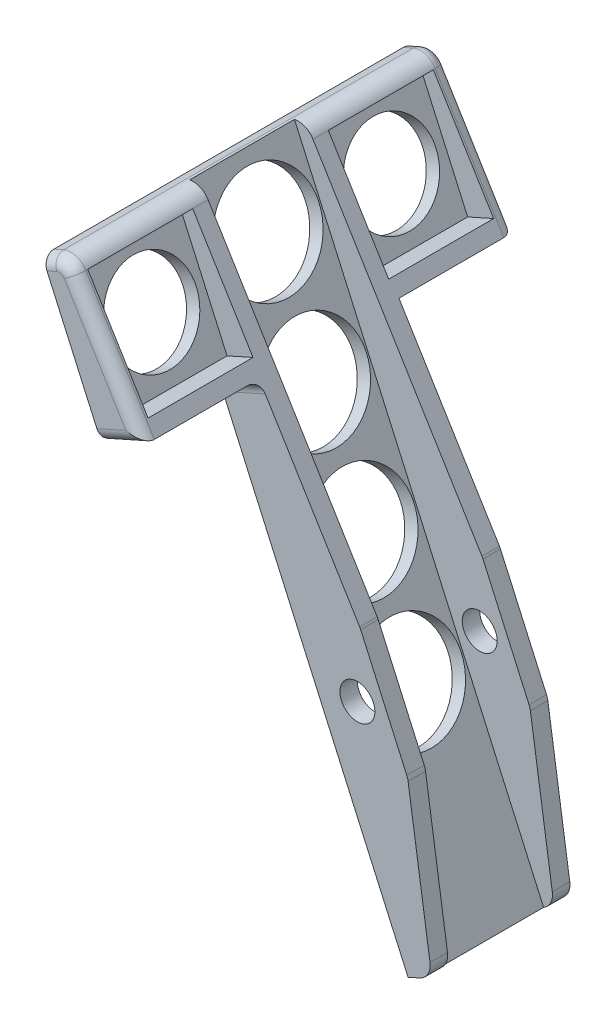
ISO-10303-21;
HEADER;
FILE_DESCRIPTION(('STEP AP214'),'2;1');
FILE_NAME('part.step','',(''),(''),'','','');
FILE_SCHEMA(('AUTOMOTIVE_DESIGN { 1 0 10303 214 1 1 1 1 }'));
ENDSEC;
DATA;
#1=APPLICATION_CONTEXT('core data for automotive mechanical design processes');
#2=APPLICATION_PROTOCOL_DEFINITION('international standard','automotive_design',2000,#1);
#3=PRODUCT_CONTEXT('',#1,'mechanical');
#4=PRODUCT('Part','Part','',(#3));
#5=PRODUCT_RELATED_PRODUCT_CATEGORY('part','',(#4));
#6=PRODUCT_DEFINITION_FORMATION('','',#4);
#7=PRODUCT_DEFINITION_CONTEXT('part definition',#1,'design');
#8=PRODUCT_DEFINITION('design','',#6,#7);
#9=PRODUCT_DEFINITION_SHAPE('','',#8);
#10=(LENGTH_UNIT() NAMED_UNIT(*) SI_UNIT(.MILLI.,.METRE.));
#11=(NAMED_UNIT(*) PLANE_ANGLE_UNIT() SI_UNIT($,.RADIAN.));
#12=(NAMED_UNIT(*) SI_UNIT($,.STERADIAN.) SOLID_ANGLE_UNIT());
#13=UNCERTAINTY_MEASURE_WITH_UNIT(LENGTH_MEASURE(1.E-05),#10,'distance_accuracy_value','');
#14=(GEOMETRIC_REPRESENTATION_CONTEXT(3) GLOBAL_UNCERTAINTY_ASSIGNED_CONTEXT((#13)) GLOBAL_UNIT_ASSIGNED_CONTEXT((#10,
#11,#12)) REPRESENTATION_CONTEXT('',''));
#15=CARTESIAN_POINT('',(0.,0.,0.));
#16=DIRECTION('',(0.,0.,1.));
#17=DIRECTION('',(1.,0.,0.));
#18=AXIS2_PLACEMENT_3D('',#15,#16,#17);
#19=CARTESIAN_POINT('',(0.48791762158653,41.8987294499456,-27.));
#20=DIRECTION('',(-0.853260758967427,-0.52148449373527,0.));
#21=DIRECTION('',(0.52148449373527,-0.853260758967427,0.));
#22=AXIS2_PLACEMENT_3D('',#19,#20,#21);
#23=PLANE('',#22);
#24=DIRECTION('',(0.52148449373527,-0.853260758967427,0.));
#25=VECTOR('',#24,1.);
#26=CARTESIAN_POINT('',(0.48791762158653,41.8987294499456,-26.6449051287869));
#27=LINE('',#26,#25);
#28=CARTESIAN_POINT('',(-28.6348307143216,89.5498075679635,-26.6449051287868));
#29=VERTEX_POINT('',#28);
#30=CARTESIAN_POINT('',(-18.2750363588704,72.5989564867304,-26.6449051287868));
#31=VERTEX_POINT('',#30);
#32=EDGE_CURVE('E300',#29,#31,#27,.T.);
#33=ORIENTED_EDGE('',*,*,#32,.F.);
#34=DIRECTION('',(0.,0.,1.));
#35=VECTOR('',#34,1.);
#36=CARTESIAN_POINT('',(-28.6348307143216,89.5498075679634,-24.));
#37=LINE('',#36,#35);
#38=CARTESIAN_POINT('',(-28.6348307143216,89.5498075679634,-24.));
#39=VERTEX_POINT('',#38);
#40=EDGE_CURVE('E617',#29,#39,#37,.T.);
#41=ORIENTED_EDGE('',*,*,#40,.T.);
#42=DIRECTION('',(-0.52148449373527,0.853260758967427,0.));
#43=VECTOR('',#42,1.);
#44=CARTESIAN_POINT('',(18.9985834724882,11.6113000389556,-24.));
#45=LINE('',#44,#43);
#46=CARTESIAN_POINT('',(0.387186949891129,42.0635464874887,-24.));
#47=VERTEX_POINT('',#46);
#48=EDGE_CURVE('E721',#47,#39,#45,.T.);
#49=ORIENTED_EDGE('',*,*,#48,.F.);
#50=DIRECTION('',(0.,0.,1.));
#51=VECTOR('',#50,1.);
#52=CARTESIAN_POINT('',(0.387186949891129,42.0635464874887,-27.));
#53=LINE('',#52,#51);
#54=CARTESIAN_POINT('',(0.387186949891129,42.0635464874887,-27.));
#55=VERTEX_POINT('',#54);
#56=EDGE_CURVE('E608',#47,#55,#53,.F.);
#57=ORIENTED_EDGE('',*,*,#56,.T.);
#58=DIRECTION('',(0.52148449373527,-0.853260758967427,0.));
#59=VECTOR('',#58,1.);
#60=CARTESIAN_POINT('',(0.48791762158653,41.8987294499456,-27.));
#61=LINE('',#60,#59);
#62=CARTESIAN_POINT('',(-16.8643513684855,70.2907725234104,-27.));
#63=VERTEX_POINT('',#62);
#64=EDGE_CURVE('E714',#63,#55,#61,.T.);
#65=ORIENTED_EDGE('',*,*,#64,.F.);
#66=DIRECTION('',(0.,0.,1.));
#67=VECTOR('',#66,1.);
#68=CARTESIAN_POINT('',(-16.8643513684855,70.2907725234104,-47.));
#69=LINE('',#68,#67);
#70=CARTESIAN_POINT('',(-16.8643513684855,70.2907725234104,-45.));
#71=VERTEX_POINT('',#70);
#72=EDGE_CURVE('E372',#71,#63,#69,.T.);
#73=ORIENTED_EDGE('',*,*,#72,.F.);
#74=DIRECTION('',(0.52148449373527,-0.853260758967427,0.));
#75=VECTOR('',#74,1.);
#76=CARTESIAN_POINT('',(-28.6348307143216,89.5498075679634,-45.));
#77=LINE('',#76,#75);
#78=CARTESIAN_POINT('',(-28.6348307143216,89.5498075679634,-45.));
#79=VERTEX_POINT('',#78);
#80=EDGE_CURVE('E819',#71,#79,#77,.F.);
#81=ORIENTED_EDGE('',*,*,#80,.T.);
#82=CARTESIAN_POINT('',(-28.6348307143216,89.5498075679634,-44.673679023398));
#83=VERTEX_POINT('',#82);
#84=EDGE_CURVE('E618',#79,#83,#37,.T.);
#85=ORIENTED_EDGE('',*,*,#84,.T.);
#86=DIRECTION('',(-0.52148449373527,0.853260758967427,0.));
#87=VECTOR('',#86,1.);
#88=CARTESIAN_POINT('',(0.487917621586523,41.8987294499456,-44.6736790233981));
#89=LINE('',#88,#87);
#90=CARTESIAN_POINT('',(-18.2750363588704,72.5989564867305,-44.673679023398));
#91=VERTEX_POINT('',#90);
#92=EDGE_CURVE('E298',#91,#83,#89,.T.);
#93=ORIENTED_EDGE('',*,*,#92,.F.);
#94=DIRECTION('',(0.,0.,-1.));
#95=VECTOR('',#94,1.);
#96=CARTESIAN_POINT('',(-18.2750363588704,72.5989564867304,-27.));
#97=LINE('',#96,#95);
#98=EDGE_CURVE('E11',#31,#91,#97,.T.);
#99=ORIENTED_EDGE('',*,*,#98,.F.);
#100=EDGE_LOOP('',(#33,#41,#49,#57,#65,#73,#81,#85,#93,#99));
#101=FACE_BOUND('',#100,.T.);
#102=ADVANCED_FACE('F34',(#101),#23,.F.);
#103=CARTESIAN_POINT('',(-10.7601607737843,86.7064378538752,-35.5849898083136));
#104=DIRECTION('',(-0.913091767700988,-0.407754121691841,0.));
#105=DIRECTION('',(0.407754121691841,-0.913091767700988,0.));
#106=AXIS2_PLACEMENT_3D('',#103,#104,#105);
#107=CYLINDRICAL_SURFACE('',#106,7.65740236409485);
#108=CARTESIAN_POINT('',(-29.0219961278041,78.5513554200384,-35.5849898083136));
#109=DIRECTION('',(-0.913091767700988,-0.407754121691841,0.));
#110=DIRECTION('',(0.407754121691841,-0.913091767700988,0.));
#111=AXIS2_PLACEMENT_3D('',#108,#109,#110);
#112=CIRCLE('',#111,7.65740236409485);
#113=CARTESIAN_POINT('',(-25.8996587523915,71.5594443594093,-35.5849898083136));
#114=VERTEX_POINT('',#113);
#115=EDGE_CURVE('E329',#114,#114,#112,.T.);
#116=ORIENTED_EDGE('',*,*,#115,.T.);
#117=EDGE_LOOP('',(#116));
#118=FACE_BOUND('',#117,.T.);
#119=CARTESIAN_POINT('',(-26.7392667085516,79.570740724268,-35.5849898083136));
#120=DIRECTION('',(0.913091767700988,0.407754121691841,0.));
#121=DIRECTION('',(-0.407754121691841,0.913091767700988,0.));
#122=AXIS2_PLACEMENT_3D('',#119,#120,#121);
#123=CIRCLE('',#122,7.65740236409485);
#124=CARTESIAN_POINT('',(-29.8616040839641,86.5626517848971,-35.5849898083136));
#125=VERTEX_POINT('',#124);
#126=EDGE_CURVE('E273',#125,#125,#123,.F.);
#127=ORIENTED_EDGE('',*,*,#126,.F.);
#128=EDGE_LOOP('',(#127));
#129=FACE_BOUND('',#128,.T.);
#130=ADVANCED_FACE('F430',(#118,#129),#107,.F.);
#131=DIRECTION('',(0.52148449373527,-0.853260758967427,0.));
#132=VECTOR('',#131,1.);
#133=CARTESIAN_POINT('',(0.48791762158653,41.8987294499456,14.673679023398));
#134=LINE('',#133,#132);
#135=CARTESIAN_POINT('',(-28.6348307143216,89.5498075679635,14.673679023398));
#136=VERTEX_POINT('',#135);
#137=CARTESIAN_POINT('',(-18.2750363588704,72.5989564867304,14.673679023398));
#138=VERTEX_POINT('',#137);
#139=EDGE_CURVE('E324',#136,#138,#134,.T.);
#140=ORIENTED_EDGE('',*,*,#139,.F.);
#141=DIRECTION('',(0.,0.,-1.));
#142=VECTOR('',#141,1.);
#143=CARTESIAN_POINT('',(-28.6348307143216,89.5498075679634,-4.50000000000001));
#144=LINE('',#143,#142);
#145=CARTESIAN_POINT('',(-28.6348307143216,89.5498075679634,15.));
#146=VERTEX_POINT('',#145);
#147=EDGE_CURVE('E659',#136,#146,#144,.F.);
#148=ORIENTED_EDGE('',*,*,#147,.T.);
#149=DIRECTION('',(-0.52148449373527,0.853260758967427,0.));
#150=VECTOR('',#149,1.);
#151=CARTESIAN_POINT('',(-16.8643513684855,70.2907725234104,15.));
#152=LINE('',#151,#150);
#153=CARTESIAN_POINT('',(-16.8643513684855,70.2907725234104,15.));
#154=VERTEX_POINT('',#153);
#155=EDGE_CURVE('E379',#146,#154,#152,.F.);
#156=ORIENTED_EDGE('',*,*,#155,.T.);
#157=DIRECTION('',(0.,0.,-1.));
#158=VECTOR('',#157,1.);
#159=CARTESIAN_POINT('',(-16.8643513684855,70.2907725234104,17.));
#160=LINE('',#159,#158);
#161=CARTESIAN_POINT('',(-16.8643513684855,70.2907725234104,-1.00000000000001));
#162=VERTEX_POINT('',#161);
#163=EDGE_CURVE('E706',#154,#162,#160,.T.);
#164=ORIENTED_EDGE('',*,*,#163,.T.);
#165=CARTESIAN_POINT('',(-15.8126987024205,68.5700426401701,-1.00000000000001));
#166=DIRECTION('',(-0.853260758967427,-0.52148449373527,0.));
#167=DIRECTION('',(-0.52148449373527,0.853260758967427,0.));
#168=AXIS2_PLACEMENT_3D('',#165,#166,#167);
#169=ELLIPSE('',#168,2.01665184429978,2.);
#170=CARTESIAN_POINT('',(-15.8126987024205,68.5700426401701,-3.00000000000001));
#171=VERTEX_POINT('',#170);
#172=EDGE_CURVE('E398',#162,#171,#169,.T.);
#173=ORIENTED_EDGE('',*,*,#172,.T.);
#174=DIRECTION('',(0.52148449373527,-0.853260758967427,0.));
#175=VECTOR('',#174,1.);
#176=CARTESIAN_POINT('',(0.48791762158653,41.8987294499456,-3.00000000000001));
#177=LINE('',#176,#175);
#178=CARTESIAN_POINT('',(0.387186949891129,42.0635464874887,-3.00000000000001));
#179=VERTEX_POINT('',#178);
#180=EDGE_CURVE('E711',#171,#179,#177,.T.);
#181=ORIENTED_EDGE('',*,*,#180,.T.);
#182=DIRECTION('',(0.,0.,1.));
#183=VECTOR('',#182,1.);
#184=CARTESIAN_POINT('',(0.387186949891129,42.0635464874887,-6.00000000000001));
#185=LINE('',#184,#183);
#186=CARTESIAN_POINT('',(0.387186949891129,42.0635464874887,-6.00000000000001));
#187=VERTEX_POINT('',#186);
#188=EDGE_CURVE('E657',#179,#187,#185,.F.);
#189=ORIENTED_EDGE('',*,*,#188,.T.);
#190=DIRECTION('',(-0.52148449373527,0.853260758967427,0.));
#191=VECTOR('',#190,1.);
#192=CARTESIAN_POINT('',(18.9985834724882,11.6113000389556,-6.00000000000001));
#193=LINE('',#192,#191);
#194=CARTESIAN_POINT('',(-28.6348307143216,89.5498075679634,-6.00000000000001));
#195=VERTEX_POINT('',#194);
#196=EDGE_CURVE('E724',#187,#195,#193,.T.);
#197=ORIENTED_EDGE('',*,*,#196,.T.);
#198=CARTESIAN_POINT('',(-28.6348307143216,89.5498075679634,-3.35509487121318));
#199=VERTEX_POINT('',#198);
#200=EDGE_CURVE('E660',#195,#199,#144,.F.);
#201=ORIENTED_EDGE('',*,*,#200,.T.);
#202=DIRECTION('',(-0.52148449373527,0.853260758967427,0.));
#203=VECTOR('',#202,1.);
#204=CARTESIAN_POINT('',(0.48791762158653,41.8987294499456,-3.35509487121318));
#205=LINE('',#204,#203);
#206=CARTESIAN_POINT('',(-18.2750363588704,72.5989564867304,-3.35509487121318));
#207=VERTEX_POINT('',#206);
#208=EDGE_CURVE('E322',#207,#199,#205,.T.);
#209=ORIENTED_EDGE('',*,*,#208,.F.);
#210=DIRECTION('',(0.,0.,-1.));
#211=VECTOR('',#210,1.);
#212=CARTESIAN_POINT('',(-18.2750363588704,72.5989564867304,-27.));
#213=LINE('',#212,#211);
#214=EDGE_CURVE('E42',#138,#207,#213,.T.);
#215=ORIENTED_EDGE('',*,*,#214,.F.);
#216=EDGE_LOOP('',(#140,#148,#156,#164,#173,#181,#189,#197,#201,#209,#215));
#217=FACE_BOUND('',#216,.T.);
#218=ADVANCED_FACE('F432',(#217),#23,.F.);
#219=CARTESIAN_POINT('',(-10.7601607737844,86.7064378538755,5.58498980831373));
#220=DIRECTION('',(-0.913091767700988,-0.407754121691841,0.));
#221=DIRECTION('',(0.407754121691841,-0.913091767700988,0.));
#222=AXIS2_PLACEMENT_3D('',#219,#220,#221);
#223=CYLINDRICAL_SURFACE('',#222,7.65740236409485);
#224=CARTESIAN_POINT('',(-29.0219961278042,78.5513554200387,5.58498980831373));
#225=DIRECTION('',(-0.913091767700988,-0.407754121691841,0.));
#226=DIRECTION('',(-0.407754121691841,0.913091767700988,0.));
#227=AXIS2_PLACEMENT_3D('',#224,#225,#226);
#228=CIRCLE('',#227,7.65740236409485);
#229=CARTESIAN_POINT('',(-32.1443335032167,85.5432664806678,5.58498980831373));
#230=VERTEX_POINT('',#229);
#231=EDGE_CURVE('E326',#230,#230,#228,.T.);
#232=ORIENTED_EDGE('',*,*,#231,.T.);
#233=EDGE_LOOP('',(#232));
#234=FACE_BOUND('',#233,.T.);
#235=CARTESIAN_POINT('',(-26.7392667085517,79.5707407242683,5.58498980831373));
#236=DIRECTION('',(0.913091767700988,0.407754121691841,0.));
#237=DIRECTION('',(-0.407754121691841,0.913091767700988,0.));
#238=AXIS2_PLACEMENT_3D('',#235,#236,#237);
#239=CIRCLE('',#238,7.65740236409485);
#240=CARTESIAN_POINT('',(-29.8616040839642,86.5626517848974,5.58498980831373));
#241=VERTEX_POINT('',#240);
#242=EDGE_CURVE('E321',#241,#241,#239,.F.);
#243=ORIENTED_EDGE('',*,*,#242,.F.);
#244=EDGE_LOOP('',(#243));
#245=FACE_BOUND('',#244,.T.);
#246=ADVANCED_FACE('F439',(#234,#245),#223,.F.);
#247=CARTESIAN_POINT('',(0.,0.,-3.00000000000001));
#248=DIRECTION('',(0.,0.,-1.));
#249=DIRECTION('',(-1.,0.,0.));
#250=AXIS2_PLACEMENT_3D('',#247,#248,#249);
#251=PLANE('',#250);
#252=CARTESIAN_POINT('',(0.,30.7290411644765,-3.00000000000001));
#253=DIRECTION('',(0.,0.,1.));
#254=DIRECTION('',(1.,0.,0.));
#255=AXIS2_PLACEMENT_3D('',#252,#253,#254);
#256=CIRCLE('',#255,3.);
#257=CARTESIAN_POINT('',(3.,30.7290411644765,-3.00000000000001));
#258=VERTEX_POINT('',#257);
#259=EDGE_CURVE('E626',#258,#258,#256,.T.);
#260=ORIENTED_EDGE('',*,*,#259,.F.);
#261=EDGE_LOOP('',(#260));
#262=FACE_BOUND('',#261,.T.);
#263=ORIENTED_EDGE('',*,*,#180,.F.);
#264=DIRECTION('',(0.913091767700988,0.407754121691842,0.));
#265=VECTOR('',#264,1.);
#266=CARTESIAN_POINT('',(-23.1095613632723,65.3115247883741,-3.00000000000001));
#267=LINE('',#266,#265);
#268=CARTESIAN_POINT('',(-23.1095613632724,65.3115247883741,-3.00000000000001));
#269=VERTEX_POINT('',#268);
#270=EDGE_CURVE('E396',#171,#269,#267,.F.);
#271=ORIENTED_EDGE('',*,*,#270,.T.);
#272=DIRECTION('',(0.407754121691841,-0.913091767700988,0.));
#273=VECTOR('',#272,1.);
#274=CARTESIAN_POINT('',(8.6952601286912,-5.90963309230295,-3.00000000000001));
#275=LINE('',#274,#273);
#276=CARTESIAN_POINT('',(8.6952601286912,-5.90963309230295,-3.00000000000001));
#277=VERTEX_POINT('',#276);
#278=EDGE_CURVE('E611',#269,#277,#275,.T.);
#279=ORIENTED_EDGE('',*,*,#278,.T.);
#280=DIRECTION('',(0.913091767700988,0.407754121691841,0.));
#281=VECTOR('',#280,1.);
#282=CARTESIAN_POINT('',(19.652361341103,-1.01658363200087,-3.00000000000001));
#283=LINE('',#282,#281);
#284=CARTESIAN_POINT('',(10.7220892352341,-5.00452371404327,-3.00000000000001));
#285=VERTEX_POINT('',#284);
#286=EDGE_CURVE('E747',#277,#285,#283,.T.);
#287=ORIENTED_EDGE('',*,*,#286,.T.);
#288=CARTESIAN_POINT('',(9.4988268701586,-2.26524841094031,-3.00000000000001));
#289=DIRECTION('',(0.,0.,-1.));
#290=DIRECTION('',(-1.,0.,0.));
#291=AXIS2_PLACEMENT_3D('',#288,#289,#290);
#292=CIRCLE('',#291,3.);
#293=CARTESIAN_POINT('',(12.4655663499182,-1.81976344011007,-3.00000000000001));
#294=VERTEX_POINT('',#293);
#295=EDGE_CURVE('E663',#285,#294,#292,.F.);
#296=ORIENTED_EDGE('',*,*,#295,.T.);
#297=DIRECTION('',(0.148494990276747,-0.988913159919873,0.));
#298=VECTOR('',#297,1.);
#299=CARTESIAN_POINT('',(8.64300005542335,23.6368940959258,-3.00000000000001));
#300=LINE('',#299,#298);
#301=CARTESIAN_POINT('',(8.70372337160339,23.2325027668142,-3.00000000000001));
#302=VERTEX_POINT('',#301);
#303=EDGE_CURVE('E766',#302,#294,#300,.T.);
#304=ORIENTED_EDGE('',*,*,#303,.F.);
#305=CARTESIAN_POINT('',(5.73698389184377,22.787017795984,-3.00000000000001));
#306=DIRECTION('',(0.,0.,-1.));
#307=DIRECTION('',(-1.,0.,0.));
#308=AXIS2_PLACEMENT_3D('',#305,#306,#307);
#309=CIRCLE('',#308,3.);
#310=CARTESIAN_POINT('',(8.47625919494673,24.0102801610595,-3.00000000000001));
#311=VERTEX_POINT('',#310);
#312=EDGE_CURVE('E666',#302,#311,#309,.F.);
#313=ORIENTED_EDGE('',*,*,#312,.T.);
#314=DIRECTION('',(-0.407754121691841,0.913091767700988,0.));
#315=VECTOR('',#314,1.);
#316=CARTESIAN_POINT('',(-23.1618214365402,94.8580519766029,-3.00000000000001));
#317=LINE('',#316,#315);
#318=CARTESIAN_POINT('',(0.566679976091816,41.7223553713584,-3.00000000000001));
#319=VERTEX_POINT('',#318);
#320=EDGE_CURVE('E782',#311,#319,#317,.T.);
#321=ORIENTED_EDGE('',*,*,#320,.T.);
#322=CARTESIAN_POINT('',(-2.17259532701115,40.4990930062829,-3.00000000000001));
#323=DIRECTION('',(0.,0.,-1.));
#324=DIRECTION('',(-1.,0.,0.));
#325=AXIS2_PLACEMENT_3D('',#322,#323,#324);
#326=CIRCLE('',#325,3.);
#327=EDGE_CURVE('E668',#319,#179,#326,.F.);
#328=ORIENTED_EDGE('',*,*,#327,.T.);
#329=EDGE_LOOP('',(#263,#271,#279,#287,#296,#304,#313,#321,#328));
#330=FACE_BOUND('',#329,.T.);
#331=ADVANCED_FACE('F516',(#262,#330),#251,.F.);
#332=CARTESIAN_POINT('',(19.652361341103,-1.01658363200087,-6.00000000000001));
#333=DIRECTION('',(0.407754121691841,-0.913091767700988,0.));
#334=DIRECTION('',(0.913091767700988,0.407754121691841,0.));
#335=AXIS2_PLACEMENT_3D('',#332,#333,#334);
#336=PLANE('',#335);
#337=DIRECTION('',(-0.913091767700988,-0.407754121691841,0.));
#338=VECTOR('',#337,1.);
#339=CARTESIAN_POINT('',(19.652361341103,-1.01658363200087,-27.));
#340=LINE('',#339,#338);
#341=CARTESIAN_POINT('',(10.7220892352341,-5.00452371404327,-27.));
#342=VERTEX_POINT('',#341);
#343=CARTESIAN_POINT('',(8.6952601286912,-5.90963309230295,-27.));
#344=VERTEX_POINT('',#343);
#345=EDGE_CURVE('E642',#342,#344,#340,.T.);
#346=ORIENTED_EDGE('',*,*,#345,.F.);
#347=DIRECTION('',(0.,0.,1.));
#348=VECTOR('',#347,1.);
#349=CARTESIAN_POINT('',(10.7220892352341,-5.00452371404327,-24.));
#350=LINE('',#349,#348);
#351=EDGE_CURVE('E699',#342,#285,#350,.T.);
#352=ORIENTED_EDGE('',*,*,#351,.T.);
#353=ORIENTED_EDGE('',*,*,#286,.F.);
#354=DIRECTION('',(0.,0.,1.));
#355=VECTOR('',#354,1.);
#356=CARTESIAN_POINT('',(8.6952601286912,-5.90963309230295,-6.00000000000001));
#357=LINE('',#356,#355);
#358=EDGE_CURVE('E604',#344,#277,#357,.T.);
#359=ORIENTED_EDGE('',*,*,#358,.F.);
#360=EDGE_LOOP('',(#346,#352,#353,#359));
#361=FACE_BOUND('',#360,.T.);
#362=ADVANCED_FACE('F519',(#361),#336,.T.);
#363=CARTESIAN_POINT('',(8.6952601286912,-5.90963309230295,-6.00000000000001));
#364=DIRECTION('',(-0.913091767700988,-0.407754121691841,0.));
#365=DIRECTION('',(0.407754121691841,-0.913091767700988,0.));
#366=AXIS2_PLACEMENT_3D('',#363,#364,#365);
#367=PLANE('',#366);
#368=ORIENTED_EDGE('',*,*,#231,.F.);
#369=EDGE_LOOP('',(#368));
#370=FACE_BOUND('',#369,.T.);
#371=ORIENTED_EDGE('',*,*,#115,.F.);
#372=EDGE_LOOP('',(#371));
#373=FACE_BOUND('',#372,.T.);
#374=CARTESIAN_POINT('',(-5.16102958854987,25.1190270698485,-14.9999999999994));
#375=DIRECTION('',(-0.913091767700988,-0.407754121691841,0.));
#376=DIRECTION('',(0.407754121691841,-0.913091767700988,0.));
#377=AXIS2_PLACEMENT_3D('',#374,#375,#376);
#378=CIRCLE('',#377,8.75107353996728);
#379=CARTESIAN_POINT('',(-1.59274328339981,17.1284938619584,-14.9999999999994));
#380=VERTEX_POINT('',#379);
#381=EDGE_CURVE('E332',#380,#380,#378,.T.);
#382=ORIENTED_EDGE('',*,*,#381,.F.);
#383=EDGE_LOOP('',(#382));
#384=FACE_BOUND('',#383,.T.);
#385=CARTESIAN_POINT('',(-13.3161120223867,43.3808624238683,-14.9999999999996));
#386=DIRECTION('',(-0.913091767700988,-0.407754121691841,0.));
#387=DIRECTION('',(0.407754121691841,-0.913091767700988,0.));
#388=AXIS2_PLACEMENT_3D('',#385,#386,#387);
#389=CIRCLE('',#388,8.75107353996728);
#390=CARTESIAN_POINT('',(-9.74782571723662,35.3903292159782,-14.9999999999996));
#391=VERTEX_POINT('',#390);
#392=EDGE_CURVE('E336',#391,#391,#389,.T.);
#393=ORIENTED_EDGE('',*,*,#392,.F.);
#394=EDGE_LOOP('',(#393));
#395=FACE_BOUND('',#394,.T.);
#396=CARTESIAN_POINT('',(-21.4711944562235,61.642697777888,-14.9999999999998));
#397=DIRECTION('',(-0.913091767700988,-0.407754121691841,0.));
#398=DIRECTION('',(0.407754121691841,-0.913091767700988,0.));
#399=AXIS2_PLACEMENT_3D('',#396,#397,#398);
#400=CIRCLE('',#399,8.75107353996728);
#401=CARTESIAN_POINT('',(-17.9029081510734,53.652164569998,-14.9999999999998));
#402=VERTEX_POINT('',#401);
#403=EDGE_CURVE('E340',#402,#402,#400,.T.);
#404=ORIENTED_EDGE('',*,*,#403,.F.);
#405=EDGE_LOOP('',(#404));
#406=FACE_BOUND('',#405,.T.);
#407=CARTESIAN_POINT('',(-29.6262768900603,79.9045331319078,-15.));
#408=DIRECTION('',(-0.913091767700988,-0.407754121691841,0.));
#409=DIRECTION('',(0.407754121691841,-0.913091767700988,0.));
#410=AXIS2_PLACEMENT_3D('',#407,#408,#409);
#411=CIRCLE('',#410,8.75107353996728);
#412=CARTESIAN_POINT('',(-26.0579905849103,71.9139999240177,-15.));
#413=VERTEX_POINT('',#412);
#414=EDGE_CURVE('E344',#413,#413,#411,.T.);
#415=ORIENTED_EDGE('',*,*,#414,.F.);
#416=EDGE_LOOP('',(#415));
#417=FACE_BOUND('',#416,.T.);
#418=DIRECTION('',(-0.407754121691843,0.913091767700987,0.));
#419=VECTOR('',#418,1.);
#420=CARTESIAN_POINT('',(-23.925069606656,67.1377083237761,-47.));
#421=LINE('',#420,#419);
#422=CARTESIAN_POINT('',(-24.7405778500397,68.9638918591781,-47.));
#423=VERTEX_POINT('',#422);
#424=CARTESIAN_POINT('',(-33.3034144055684,88.1388189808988,-47.));
#425=VERTEX_POINT('',#424);
#426=EDGE_CURVE('E348',#423,#425,#421,.T.);
#427=ORIENTED_EDGE('',*,*,#426,.F.);
#428=CARTESIAN_POINT('',(-24.7405778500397,68.9638918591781,-45.));
#429=DIRECTION('',(-0.913091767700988,-0.407754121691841,0.));
#430=DIRECTION('',(0.407754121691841,-0.913091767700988,0.));
#431=AXIS2_PLACEMENT_3D('',#428,#429,#430);
#432=CIRCLE('',#431,2.);
#433=CARTESIAN_POINT('',(-23.925069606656,67.1377083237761,-45.));
#434=VERTEX_POINT('',#433);
#435=EDGE_CURVE('E383',#423,#434,#432,.T.);
#436=ORIENTED_EDGE('',*,*,#435,.T.);
#437=DIRECTION('',(0.,0.,1.));
#438=VECTOR('',#437,1.);
#439=CARTESIAN_POINT('',(-23.925069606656,67.1377083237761,-47.));
#440=LINE('',#439,#438);
#441=CARTESIAN_POINT('',(-23.925069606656,67.1377083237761,-27.));
#442=VERTEX_POINT('',#441);
#443=EDGE_CURVE('E351',#434,#442,#440,.T.);
#444=ORIENTED_EDGE('',*,*,#443,.T.);
#445=DIRECTION('',(-0.407754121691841,0.913091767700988,0.));
#446=VECTOR('',#445,1.);
#447=CARTESIAN_POINT('',(8.6952601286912,-5.90963309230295,-27.));
#448=LINE('',#447,#446);
#449=EDGE_CURVE('E362',#344,#442,#448,.T.);
#450=ORIENTED_EDGE('',*,*,#449,.F.);
#451=ORIENTED_EDGE('',*,*,#358,.T.);
#452=ORIENTED_EDGE('',*,*,#278,.F.);
#453=CARTESIAN_POINT('',(-23.1095613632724,65.3115247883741,-1.00000000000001));
#454=DIRECTION('',(-0.913091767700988,-0.407754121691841,0.));
#455=DIRECTION('',(0.407754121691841,-0.913091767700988,0.));
#456=AXIS2_PLACEMENT_3D('',#453,#454,#455);
#457=CIRCLE('',#456,2.);
#458=CARTESIAN_POINT('',(-23.925069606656,67.1377083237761,-1.00000000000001));
#459=VERTEX_POINT('',#458);
#460=EDGE_CURVE('E400',#269,#459,#457,.F.);
#461=ORIENTED_EDGE('',*,*,#460,.T.);
#462=DIRECTION('',(0.,0.,-1.));
#463=VECTOR('',#462,1.);
#464=CARTESIAN_POINT('',(-23.925069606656,67.1377083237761,17.));
#465=LINE('',#464,#463);
#466=CARTESIAN_POINT('',(-23.925069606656,67.1377083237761,15.));
#467=VERTEX_POINT('',#466);
#468=EDGE_CURVE('E373',#467,#459,#465,.T.);
#469=ORIENTED_EDGE('',*,*,#468,.F.);
#470=CARTESIAN_POINT('',(-24.7405778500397,68.9638918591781,15.));
#471=DIRECTION('',(-0.913091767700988,-0.407754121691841,0.));
#472=DIRECTION('',(0.407754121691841,-0.913091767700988,0.));
#473=AXIS2_PLACEMENT_3D('',#470,#471,#472);
#474=CIRCLE('',#473,2.);
#475=CARTESIAN_POINT('',(-24.7405778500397,68.9638918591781,17.));
#476=VERTEX_POINT('',#475);
#477=EDGE_CURVE('E376',#467,#476,#474,.T.);
#478=ORIENTED_EDGE('',*,*,#477,.T.);
#479=DIRECTION('',(0.407754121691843,-0.913091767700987,0.));
#480=VECTOR('',#479,1.);
#481=CARTESIAN_POINT('',(-34.1189226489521,89.9650025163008,17.));
#482=LINE('',#481,#480);
#483=CARTESIAN_POINT('',(-33.3034144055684,88.1388189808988,17.));
#484=VERTEX_POINT('',#483);
#485=EDGE_CURVE('E355',#484,#476,#482,.T.);
#486=ORIENTED_EDGE('',*,*,#485,.F.);
#487=CARTESIAN_POINT('',(-33.3034144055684,88.1388189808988,15.));
#488=DIRECTION('',(-0.913091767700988,-0.407754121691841,0.));
#489=DIRECTION('',(0.407754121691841,-0.913091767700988,0.));
#490=AXIS2_PLACEMENT_3D('',#487,#488,#489);
#491=CIRCLE('',#490,2.);
#492=CARTESIAN_POINT('',(-34.1189226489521,89.9650025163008,15.));
#493=VERTEX_POINT('',#492);
#494=EDGE_CURVE('E378',#484,#493,#491,.T.);
#495=ORIENTED_EDGE('',*,*,#494,.T.);
#496=DIRECTION('',(0.,0.,1.));
#497=VECTOR('',#496,1.);
#498=CARTESIAN_POINT('',(-34.1189226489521,89.9650025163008,-6.00000000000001));
#499=LINE('',#498,#497);
#500=CARTESIAN_POINT('',(-34.1189226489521,89.9650025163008,-45.));
#501=VERTEX_POINT('',#500);
#502=EDGE_CURVE('E598',#501,#493,#499,.T.);
#503=ORIENTED_EDGE('',*,*,#502,.F.);
#504=CARTESIAN_POINT('',(-33.3034144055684,88.1388189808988,-45.));
#505=DIRECTION('',(-0.913091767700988,-0.407754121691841,0.));
#506=DIRECTION('',(0.407754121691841,-0.913091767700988,0.));
#507=AXIS2_PLACEMENT_3D('',#504,#505,#506);
#508=CIRCLE('',#507,2.);
#509=EDGE_CURVE('E381',#501,#425,#508,.T.);
#510=ORIENTED_EDGE('',*,*,#509,.T.);
#511=EDGE_LOOP('',(#427,#436,#444,#450,#451,#452,#461,#469,#478,#486,#495,#503,#510));
#512=FACE_BOUND('',#511,.T.);
#513=ADVANCED_FACE('F521',(#370,#373,#384,#395,#406,#417,#512),#367,.T.);
#514=CARTESIAN_POINT('',(-34.1189226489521,89.9650025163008,-6.00000000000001));
#515=DIRECTION('',(-0.407754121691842,0.913091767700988,0.));
#516=DIRECTION('',(-0.913091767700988,-0.407754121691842,0.));
#517=AXIS2_PLACEMENT_3D('',#514,#515,#516);
#518=PLANE('',#517);
#519=DIRECTION('',(0.,0.,1.));
#520=VECTOR('',#519,1.);
#521=CARTESIAN_POINT('',(-32.4178753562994,90.7246293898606,-27.));
#522=LINE('',#521,#520);
#523=CARTESIAN_POINT('',(-32.4178753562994,90.7246293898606,15.));
#524=VERTEX_POINT('',#523);
#525=CARTESIAN_POINT('',(-32.4178753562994,90.7246293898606,-45.));
#526=VERTEX_POINT('',#525);
#527=EDGE_CURVE('E671',#524,#526,#522,.F.);
#528=ORIENTED_EDGE('',*,*,#527,.T.);
#529=DIRECTION('',(0.913091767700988,0.407754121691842,0.));
#530=VECTOR('',#529,1.);
#531=CARTESIAN_POINT('',(-34.1189226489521,89.9650025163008,-45.));
#532=LINE('',#531,#530);
#533=EDGE_CURVE('E389',#526,#501,#532,.F.);
#534=ORIENTED_EDGE('',*,*,#533,.T.);
#535=ORIENTED_EDGE('',*,*,#502,.T.);
#536=DIRECTION('',(-0.913091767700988,-0.407754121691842,0.));
#537=VECTOR('',#536,1.);
#538=CARTESIAN_POINT('',(-34.1189226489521,89.9650025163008,15.));
#539=LINE('',#538,#537);
#540=EDGE_CURVE('E387',#493,#524,#539,.F.);
#541=ORIENTED_EDGE('',*,*,#540,.T.);
#542=EDGE_LOOP('',(#528,#534,#535,#541));
#543=FACE_BOUND('',#542,.T.);
#544=ADVANCED_FACE('F524',(#543),#518,.T.);
#545=CARTESIAN_POINT('',(-23.1618214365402,94.8580519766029,-6.00000000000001));
#546=DIRECTION('',(0.913091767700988,0.407754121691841,0.));
#547=DIRECTION('',(-0.407754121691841,0.913091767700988,0.));
#548=AXIS2_PLACEMENT_3D('',#545,#546,#547);
#549=PLANE('',#548);
#550=DIRECTION('',(-0.407754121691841,0.913091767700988,0.));
#551=VECTOR('',#550,1.);
#552=CARTESIAN_POINT('',(-23.1618214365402,94.8580519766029,-6.00000000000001));
#553=LINE('',#552,#551);
#554=CARTESIAN_POINT('',(8.47625919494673,24.0102801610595,-6.00000000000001));
#555=VERTEX_POINT('',#554);
#556=CARTESIAN_POINT('',(0.566679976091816,41.7223553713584,-6.00000000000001));
#557=VERTEX_POINT('',#556);
#558=EDGE_CURVE('E605',#555,#557,#553,.T.);
#559=ORIENTED_EDGE('',*,*,#558,.T.);
#560=DIRECTION('',(0.,0.,1.));
#561=VECTOR('',#560,1.);
#562=CARTESIAN_POINT('',(0.566679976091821,41.7223553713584,-3.00000000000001));
#563=LINE('',#562,#561);
#564=EDGE_CURVE('E681',#557,#319,#563,.T.);
#565=ORIENTED_EDGE('',*,*,#564,.T.);
#566=ORIENTED_EDGE('',*,*,#320,.F.);
#567=DIRECTION('',(0.,0.,1.));
#568=VECTOR('',#567,1.);
#569=CARTESIAN_POINT('',(8.47625919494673,24.0102801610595,-6.00000000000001));
#570=LINE('',#569,#568);
#571=EDGE_CURVE('E679',#311,#555,#570,.F.);
#572=ORIENTED_EDGE('',*,*,#571,.T.);
#573=EDGE_LOOP('',(#559,#565,#566,#572));
#574=FACE_BOUND('',#573,.T.);
#575=ADVANCED_FACE('F514',(#574),#549,.T.);
#576=CARTESIAN_POINT('',(0.,0.,-6.00000000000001));
#577=DIRECTION('',(0.,0.,-1.));
#578=DIRECTION('',(-1.,0.,0.));
#579=AXIS2_PLACEMENT_3D('',#576,#577,#578);
#580=PLANE('',#579);
#581=DIRECTION('',(0.407754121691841,-0.913091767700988,0.));
#582=VECTOR('',#581,1.);
#583=CARTESIAN_POINT('',(10.9779895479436,-4.89024778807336,-6.00000000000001));
#584=LINE('',#583,#582);
#585=CARTESIAN_POINT('',(-31.8082953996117,90.9219156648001,-6.00000000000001));
#586=VERTEX_POINT('',#585);
#587=CARTESIAN_POINT('',(10.9726400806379,-4.87826862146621,-6.00000000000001));
#588=VERTEX_POINT('',#587);
#589=EDGE_CURVE('E627',#586,#588,#584,.T.);
#590=ORIENTED_EDGE('',*,*,#589,.F.);
#591=CARTESIAN_POINT('',(-31.1946129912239,87.9853540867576,-6.00000000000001));
#592=DIRECTION('',(0.,0.,-1.));
#593=DIRECTION('',(-1.,0.,0.));
#594=AXIS2_PLACEMENT_3D('',#591,#592,#593);
#595=CIRCLE('',#594,3.);
#596=EDGE_CURVE('E655',#586,#195,#595,.T.);
#597=ORIENTED_EDGE('',*,*,#596,.T.);
#598=ORIENTED_EDGE('',*,*,#196,.F.);
#599=CARTESIAN_POINT('',(-2.17259532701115,40.4990930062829,-6.00000000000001));
#600=DIRECTION('',(0.,0.,-1.));
#601=DIRECTION('',(-1.,0.,0.));
#602=AXIS2_PLACEMENT_3D('',#599,#600,#601);
#603=CIRCLE('',#602,3.);
#604=EDGE_CURVE('E653',#187,#557,#603,.T.);
#605=ORIENTED_EDGE('',*,*,#604,.T.);
#606=ORIENTED_EDGE('',*,*,#558,.F.);
#607=CARTESIAN_POINT('',(5.73698389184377,22.787017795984,-6.00000000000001));
#608=DIRECTION('',(0.,0.,-1.));
#609=DIRECTION('',(-1.,0.,0.));
#610=AXIS2_PLACEMENT_3D('',#607,#608,#609);
#611=CIRCLE('',#610,3.);
#612=CARTESIAN_POINT('',(8.70372337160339,23.2325027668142,-6.00000000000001));
#613=VERTEX_POINT('',#612);
#614=EDGE_CURVE('E651',#555,#613,#611,.T.);
#615=ORIENTED_EDGE('',*,*,#614,.T.);
#616=DIRECTION('',(-0.148494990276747,0.988913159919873,0.));
#617=VECTOR('',#616,1.);
#618=CARTESIAN_POINT('',(11.9234613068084,1.79042442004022,-6.00000000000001));
#619=LINE('',#618,#617);
#620=CARTESIAN_POINT('',(12.4655663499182,-1.81976344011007,-6.00000000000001));
#621=VERTEX_POINT('',#620);
#622=EDGE_CURVE('E715',#621,#613,#619,.T.);
#623=ORIENTED_EDGE('',*,*,#622,.F.);
#624=CARTESIAN_POINT('',(9.4988268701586,-2.26524841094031,-6.00000000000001));
#625=DIRECTION('',(0.,0.,-1.));
#626=DIRECTION('',(-1.,0.,0.));
#627=AXIS2_PLACEMENT_3D('',#624,#625,#626);
#628=CIRCLE('',#627,3.);
#629=EDGE_CURVE('E649',#621,#588,#628,.T.);
#630=ORIENTED_EDGE('',*,*,#629,.T.);
#631=EDGE_LOOP('',(#590,#597,#598,#605,#606,#615,#623,#630));
#632=FACE_BOUND('',#631,.T.);
#633=CARTESIAN_POINT('',(0.,30.7290411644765,-6.00000000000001));
#634=DIRECTION('',(0.,0.,1.));
#635=DIRECTION('',(1.,0.,0.));
#636=AXIS2_PLACEMENT_3D('',#633,#634,#635);
#637=CIRCLE('',#636,3.);
#638=CARTESIAN_POINT('',(3.,30.7290411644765,-6.00000000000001));
#639=VERTEX_POINT('',#638);
#640=EDGE_CURVE('E636',#639,#639,#637,.T.);
#641=ORIENTED_EDGE('',*,*,#640,.T.);
#642=EDGE_LOOP('',(#641));
#643=FACE_BOUND('',#642,.T.);
#644=ADVANCED_FACE('F510',(#632,#643),#580,.T.);
#645=CARTESIAN_POINT('',(0.,30.7290411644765,-6.00000000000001));
#646=DIRECTION('',(0.,0.,1.));
#647=DIRECTION('',(1.,0.,0.));
#648=AXIS2_PLACEMENT_3D('',#645,#646,#647);
#649=CYLINDRICAL_SURFACE('',#648,3.);
#650=ORIENTED_EDGE('',*,*,#640,.F.);
#651=EDGE_LOOP('',(#650));
#652=FACE_BOUND('',#651,.T.);
#653=ORIENTED_EDGE('',*,*,#259,.T.);
#654=EDGE_LOOP('',(#653));
#655=FACE_BOUND('',#654,.T.);
#656=ADVANCED_FACE('F506',(#652,#655),#649,.F.);
#657=CARTESIAN_POINT('',(10.9779895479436,-4.89024778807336,-24.));
#658=DIRECTION('',(-0.913091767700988,-0.407754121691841,0.));
#659=DIRECTION('',(0.407754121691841,-0.913091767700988,0.));
#660=AXIS2_PLACEMENT_3D('',#657,#658,#659);
#661=PLANE('',#660);
#662=CARTESIAN_POINT('',(-2.87830016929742,26.1384123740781,-14.9999999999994));
#663=DIRECTION('',(-0.913091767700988,-0.407754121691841,0.));
#664=DIRECTION('',(0.407754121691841,-0.913091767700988,0.));
#665=AXIS2_PLACEMENT_3D('',#662,#663,#664);
#666=CIRCLE('',#665,8.75107353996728);
#667=CARTESIAN_POINT('',(0.689986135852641,18.147879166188,-14.9999999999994));
#668=VERTEX_POINT('',#667);
#669=EDGE_CURVE('E335',#668,#668,#666,.T.);
#670=ORIENTED_EDGE('',*,*,#669,.T.);
#671=EDGE_LOOP('',(#670));
#672=FACE_BOUND('',#671,.T.);
#673=CARTESIAN_POINT('',(-11.0333826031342,44.4002477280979,-14.9999999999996));
#674=DIRECTION('',(-0.913091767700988,-0.407754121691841,0.));
#675=DIRECTION('',(0.407754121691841,-0.913091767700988,0.));
#676=AXIS2_PLACEMENT_3D('',#673,#674,#675);
#677=CIRCLE('',#676,8.75107353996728);
#678=CARTESIAN_POINT('',(-7.46509629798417,36.4097145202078,-14.9999999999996));
#679=VERTEX_POINT('',#678);
#680=EDGE_CURVE('E339',#679,#679,#677,.T.);
#681=ORIENTED_EDGE('',*,*,#680,.T.);
#682=EDGE_LOOP('',(#681));
#683=FACE_BOUND('',#682,.T.);
#684=CARTESIAN_POINT('',(-19.188465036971,62.6620830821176,-14.9999999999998));
#685=DIRECTION('',(-0.913091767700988,-0.407754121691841,0.));
#686=DIRECTION('',(0.407754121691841,-0.913091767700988,0.));
#687=AXIS2_PLACEMENT_3D('',#684,#685,#686);
#688=CIRCLE('',#687,8.75107353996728);
#689=CARTESIAN_POINT('',(-15.620178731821,54.6715498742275,-14.9999999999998));
#690=VERTEX_POINT('',#689);
#691=EDGE_CURVE('E343',#690,#690,#688,.T.);
#692=ORIENTED_EDGE('',*,*,#691,.T.);
#693=EDGE_LOOP('',(#692));
#694=FACE_BOUND('',#693,.T.);
#695=CARTESIAN_POINT('',(-27.3435474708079,80.9239184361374,-15.));
#696=DIRECTION('',(-0.913091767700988,-0.407754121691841,0.));
#697=DIRECTION('',(0.407754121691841,-0.913091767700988,0.));
#698=AXIS2_PLACEMENT_3D('',#695,#696,#697);
#699=CIRCLE('',#698,8.75107353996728);
#700=CARTESIAN_POINT('',(-23.7752611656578,72.9333852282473,-15.));
#701=VERTEX_POINT('',#700);
#702=EDGE_CURVE('E347',#701,#701,#699,.T.);
#703=ORIENTED_EDGE('',*,*,#702,.T.);
#704=EDGE_LOOP('',(#703));
#705=FACE_BOUND('',#704,.T.);
#706=DIRECTION('',(0.407754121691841,-0.913091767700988,0.));
#707=VECTOR('',#706,1.);
#708=CARTESIAN_POINT('',(10.9779895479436,-4.89024778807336,-24.));
#709=LINE('',#708,#707);
#710=CARTESIAN_POINT('',(-31.8082953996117,90.9219156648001,-24.));
#711=VERTEX_POINT('',#710);
#712=CARTESIAN_POINT('',(10.9726400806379,-4.87826862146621,-24.));
#713=VERTEX_POINT('',#712);
#714=EDGE_CURVE('E622',#711,#713,#709,.T.);
#715=ORIENTED_EDGE('',*,*,#714,.F.);
#716=DIRECTION('',(0.,0.,-1.));
#717=VECTOR('',#716,1.);
#718=CARTESIAN_POINT('',(-31.8082953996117,90.9219156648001,-24.));
#719=LINE('',#718,#717);
#720=EDGE_CURVE('E647',#711,#586,#719,.F.);
#721=ORIENTED_EDGE('',*,*,#720,.T.);
#722=ORIENTED_EDGE('',*,*,#589,.T.);
#723=DIRECTION('',(0.,0.,-1.));
#724=VECTOR('',#723,1.);
#725=CARTESIAN_POINT('',(10.9726400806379,-4.87826862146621,-6.00000000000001));
#726=LINE('',#725,#724);
#727=EDGE_CURVE('E645',#588,#713,#726,.T.);
#728=ORIENTED_EDGE('',*,*,#727,.T.);
#729=EDGE_LOOP('',(#715,#721,#722,#728));
#730=FACE_BOUND('',#729,.T.);
#731=ADVANCED_FACE('F499',(#672,#683,#694,#705,#730),#661,.F.);
#732=CARTESIAN_POINT('',(0.,0.,-24.));
#733=DIRECTION('',(0.,0.,-1.));
#734=DIRECTION('',(-1.,0.,0.));
#735=AXIS2_PLACEMENT_3D('',#732,#733,#734);
#736=PLANE('',#735);
#737=CARTESIAN_POINT('',(0.,30.7290411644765,-24.));
#738=DIRECTION('',(0.,0.,-1.));
#739=DIRECTION('',(-1.,0.,0.));
#740=AXIS2_PLACEMENT_3D('',#737,#738,#739);
#741=CIRCLE('',#740,3.);
#742=CARTESIAN_POINT('',(-3.,30.7290411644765,-24.));
#743=VERTEX_POINT('',#742);
#744=EDGE_CURVE('E727',#743,#743,#741,.T.);
#745=ORIENTED_EDGE('',*,*,#744,.T.);
#746=EDGE_LOOP('',(#745));
#747=FACE_BOUND('',#746,.T.);
#748=ORIENTED_EDGE('',*,*,#48,.T.);
#749=CARTESIAN_POINT('',(-31.1946129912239,87.9853540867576,-24.));
#750=DIRECTION('',(0.,0.,-1.));
#751=DIRECTION('',(-1.,0.,0.));
#752=AXIS2_PLACEMENT_3D('',#749,#750,#751);
#753=CIRCLE('',#752,3.);
#754=EDGE_CURVE('E643',#39,#711,#753,.F.);
#755=ORIENTED_EDGE('',*,*,#754,.T.);
#756=ORIENTED_EDGE('',*,*,#714,.T.);
#757=CARTESIAN_POINT('',(9.4988268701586,-2.26524841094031,-24.));
#758=DIRECTION('',(0.,0.,-1.));
#759=DIRECTION('',(-1.,0.,0.));
#760=AXIS2_PLACEMENT_3D('',#757,#758,#759);
#761=CIRCLE('',#760,3.);
#762=CARTESIAN_POINT('',(12.4655663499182,-1.81976344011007,-24.));
#763=VERTEX_POINT('',#762);
#764=EDGE_CURVE('E621',#713,#763,#761,.F.);
#765=ORIENTED_EDGE('',*,*,#764,.T.);
#766=DIRECTION('',(-0.148494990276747,0.988913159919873,0.));
#767=VECTOR('',#766,1.);
#768=CARTESIAN_POINT('',(11.9234613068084,1.79042442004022,-24.));
#769=LINE('',#768,#767);
#770=CARTESIAN_POINT('',(8.70372337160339,23.2325027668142,-24.));
#771=VERTEX_POINT('',#770);
#772=EDGE_CURVE('E765',#763,#771,#769,.T.);
#773=ORIENTED_EDGE('',*,*,#772,.T.);
#774=CARTESIAN_POINT('',(5.73698389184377,22.787017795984,-24.));
#775=DIRECTION('',(0.,0.,-1.));
#776=DIRECTION('',(-1.,0.,0.));
#777=AXIS2_PLACEMENT_3D('',#774,#775,#776);
#778=CIRCLE('',#777,3.);
#779=CARTESIAN_POINT('',(8.47625919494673,24.0102801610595,-24.));
#780=VERTEX_POINT('',#779);
#781=EDGE_CURVE('E758',#771,#780,#778,.F.);
#782=ORIENTED_EDGE('',*,*,#781,.T.);
#783=DIRECTION('',(0.407754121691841,-0.913091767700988,0.));
#784=VECTOR('',#783,1.);
#785=CARTESIAN_POINT('',(-23.1618214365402,94.8580519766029,-24.));
#786=LINE('',#785,#784);
#787=CARTESIAN_POINT('',(0.566679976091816,41.7223553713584,-24.));
#788=VERTEX_POINT('',#787);
#789=EDGE_CURVE('E632',#788,#780,#786,.T.);
#790=ORIENTED_EDGE('',*,*,#789,.F.);
#791=CARTESIAN_POINT('',(-2.17259532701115,40.4990930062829,-24.));
#792=DIRECTION('',(0.,0.,-1.));
#793=DIRECTION('',(-1.,0.,0.));
#794=AXIS2_PLACEMENT_3D('',#791,#792,#793);
#795=CIRCLE('',#794,3.);
#796=EDGE_CURVE('E845',#788,#47,#795,.F.);
#797=ORIENTED_EDGE('',*,*,#796,.T.);
#798=EDGE_LOOP('',(#748,#755,#756,#765,#773,#782,#790,#797));
#799=FACE_BOUND('',#798,.T.);
#800=ADVANCED_FACE('F495',(#747,#799),#736,.F.);
#801=CARTESIAN_POINT('',(0.,0.,-27.));
#802=DIRECTION('',(0.,0.,-1.));
#803=DIRECTION('',(-1.,0.,0.));
#804=AXIS2_PLACEMENT_3D('',#801,#802,#803);
#805=PLANE('',#804);
#806=DIRECTION('',(-0.913091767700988,-0.407754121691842,0.));
#807=VECTOR('',#806,1.);
#808=CARTESIAN_POINT('',(-16.8643513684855,70.2907725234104,-27.));
#809=LINE('',#808,#807);
#810=EDGE_CURVE('E352',#63,#442,#809,.T.);
#811=ORIENTED_EDGE('',*,*,#810,.F.);
#812=ORIENTED_EDGE('',*,*,#64,.T.);
#813=CARTESIAN_POINT('',(-2.17259532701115,40.4990930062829,-27.));
#814=DIRECTION('',(0.,0.,-1.));
#815=DIRECTION('',(-1.,0.,0.));
#816=AXIS2_PLACEMENT_3D('',#813,#814,#815);
#817=CIRCLE('',#816,3.);
#818=CARTESIAN_POINT('',(0.566679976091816,41.7223553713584,-27.));
#819=VERTEX_POINT('',#818);
#820=EDGE_CURVE('E677',#55,#819,#817,.T.);
#821=ORIENTED_EDGE('',*,*,#820,.T.);
#822=DIRECTION('',(0.407754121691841,-0.913091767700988,0.));
#823=VECTOR('',#822,1.);
#824=CARTESIAN_POINT('',(-23.1618214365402,94.8580519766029,-27.));
#825=LINE('',#824,#823);
#826=CARTESIAN_POINT('',(8.47625919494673,24.0102801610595,-27.));
#827=VERTEX_POINT('',#826);
#828=EDGE_CURVE('E734',#819,#827,#825,.T.);
#829=ORIENTED_EDGE('',*,*,#828,.T.);
#830=CARTESIAN_POINT('',(5.73698389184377,22.787017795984,-27.));
#831=DIRECTION('',(0.,0.,-1.));
#832=DIRECTION('',(-1.,0.,0.));
#833=AXIS2_PLACEMENT_3D('',#830,#831,#832);
#834=CIRCLE('',#833,3.);
#835=CARTESIAN_POINT('',(8.70372337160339,23.2325027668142,-27.));
#836=VERTEX_POINT('',#835);
#837=EDGE_CURVE('E675',#827,#836,#834,.T.);
#838=ORIENTED_EDGE('',*,*,#837,.T.);
#839=DIRECTION('',(0.148494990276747,-0.988913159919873,0.));
#840=VECTOR('',#839,1.);
#841=CARTESIAN_POINT('',(8.64300005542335,23.6368940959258,-27.));
#842=LINE('',#841,#840);
#843=CARTESIAN_POINT('',(12.4655663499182,-1.81976344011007,-27.));
#844=VERTEX_POINT('',#843);
#845=EDGE_CURVE('E760',#836,#844,#842,.T.);
#846=ORIENTED_EDGE('',*,*,#845,.T.);
#847=CARTESIAN_POINT('',(9.4988268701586,-2.26524841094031,-27.));
#848=DIRECTION('',(0.,0.,-1.));
#849=DIRECTION('',(-1.,0.,0.));
#850=AXIS2_PLACEMENT_3D('',#847,#848,#849);
#851=CIRCLE('',#850,3.);
#852=EDGE_CURVE('E673',#844,#342,#851,.T.);
#853=ORIENTED_EDGE('',*,*,#852,.T.);
#854=ORIENTED_EDGE('',*,*,#345,.T.);
#855=ORIENTED_EDGE('',*,*,#449,.T.);
#856=EDGE_LOOP('',(#811,#812,#821,#829,#838,#846,#853,#854,#855));
#857=FACE_BOUND('',#856,.T.);
#858=CARTESIAN_POINT('',(0.,30.7290411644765,-27.));
#859=DIRECTION('',(0.,0.,-1.));
#860=DIRECTION('',(-1.,0.,0.));
#861=AXIS2_PLACEMENT_3D('',#858,#859,#860);
#862=CIRCLE('',#861,3.);
#863=CARTESIAN_POINT('',(-3.,30.7290411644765,-27.));
#864=VERTEX_POINT('',#863);
#865=EDGE_CURVE('E728',#864,#864,#862,.T.);
#866=ORIENTED_EDGE('',*,*,#865,.F.);
#867=EDGE_LOOP('',(#866));
#868=FACE_BOUND('',#867,.T.);
#869=ADVANCED_FACE('F492',(#857,#868),#805,.T.);
#870=CARTESIAN_POINT('',(-23.1618214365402,94.8580519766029,-27.));
#871=DIRECTION('',(-0.913091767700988,-0.407754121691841,0.));
#872=DIRECTION('',(0.407754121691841,-0.913091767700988,0.));
#873=AXIS2_PLACEMENT_3D('',#870,#871,#872);
#874=PLANE('',#873);
#875=ORIENTED_EDGE('',*,*,#828,.F.);
#876=DIRECTION('',(0.,0.,1.));
#877=VECTOR('',#876,1.);
#878=CARTESIAN_POINT('',(0.566679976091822,41.7223553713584,-27.));
#879=LINE('',#878,#877);
#880=EDGE_CURVE('E686',#819,#788,#879,.T.);
#881=ORIENTED_EDGE('',*,*,#880,.T.);
#882=ORIENTED_EDGE('',*,*,#789,.T.);
#883=DIRECTION('',(0.,0.,1.));
#884=VECTOR('',#883,1.);
#885=CARTESIAN_POINT('',(8.47625919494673,24.0102801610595,-27.));
#886=LINE('',#885,#884);
#887=EDGE_CURVE('E684',#780,#827,#886,.F.);
#888=ORIENTED_EDGE('',*,*,#887,.T.);
#889=EDGE_LOOP('',(#875,#881,#882,#888));
#890=FACE_BOUND('',#889,.T.);
#891=ADVANCED_FACE('F490',(#890),#874,.F.);
#892=CARTESIAN_POINT('',(0.,30.7290411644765,-27.));
#893=DIRECTION('',(0.,0.,1.));
#894=DIRECTION('',(1.,0.,0.));
#895=AXIS2_PLACEMENT_3D('',#892,#893,#894);
#896=CYLINDRICAL_SURFACE('',#895,3.);
#897=ORIENTED_EDGE('',*,*,#865,.T.);
#898=EDGE_LOOP('',(#897));
#899=FACE_BOUND('',#898,.T.);
#900=ORIENTED_EDGE('',*,*,#744,.F.);
#901=EDGE_LOOP('',(#900));
#902=FACE_BOUND('',#901,.T.);
#903=ADVANCED_FACE('F487',(#899,#902),#896,.F.);
#904=CARTESIAN_POINT('',(8.64300005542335,23.6368940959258,-27.));
#905=DIRECTION('',(-0.988913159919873,-0.148494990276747,0.));
#906=DIRECTION('',(0.148494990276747,-0.988913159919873,0.));
#907=AXIS2_PLACEMENT_3D('',#904,#905,#906);
#908=PLANE('',#907);
#909=ORIENTED_EDGE('',*,*,#845,.F.);
#910=DIRECTION('',(0.,0.,1.));
#911=VECTOR('',#910,1.);
#912=CARTESIAN_POINT('',(8.70372337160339,23.2325027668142,-27.));
#913=LINE('',#912,#911);
#914=EDGE_CURVE('E696',#836,#771,#913,.T.);
#915=ORIENTED_EDGE('',*,*,#914,.T.);
#916=ORIENTED_EDGE('',*,*,#772,.F.);
#917=DIRECTION('',(0.,0.,1.));
#918=VECTOR('',#917,1.);
#919=CARTESIAN_POINT('',(12.4655663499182,-1.81976344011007,-27.));
#920=LINE('',#919,#918);
#921=EDGE_CURVE('E694',#763,#844,#920,.F.);
#922=ORIENTED_EDGE('',*,*,#921,.T.);
#923=EDGE_LOOP('',(#909,#915,#916,#922));
#924=FACE_BOUND('',#923,.T.);
#925=ADVANCED_FACE('F484',(#924),#908,.F.);
#926=ORIENTED_EDGE('',*,*,#622,.T.);
#927=DIRECTION('',(0.,0.,1.));
#928=VECTOR('',#927,1.);
#929=CARTESIAN_POINT('',(8.70372337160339,23.2325027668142,-3.00000000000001));
#930=LINE('',#929,#928);
#931=EDGE_CURVE('E691',#613,#302,#930,.T.);
#932=ORIENTED_EDGE('',*,*,#931,.T.);
#933=ORIENTED_EDGE('',*,*,#303,.T.);
#934=DIRECTION('',(0.,0.,-1.));
#935=VECTOR('',#934,1.);
#936=CARTESIAN_POINT('',(12.4655663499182,-1.81976344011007,-4.50000000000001));
#937=LINE('',#936,#935);
#938=EDGE_CURVE('E689',#294,#621,#937,.T.);
#939=ORIENTED_EDGE('',*,*,#938,.T.);
#940=EDGE_LOOP('',(#926,#932,#933,#939));
#941=FACE_BOUND('',#940,.T.);
#942=ADVANCED_FACE('F481',(#941),#908,.F.);
#943=CARTESIAN_POINT('',(-31.1946129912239,87.9853540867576,-27.));
#944=DIRECTION('',(0.,0.,-1.));
#945=DIRECTION('',(-1.,0.,0.));
#946=AXIS2_PLACEMENT_3D('',#943,#944,#945);
#947=CYLINDRICAL_SURFACE('',#946,3.);
#948=ORIENTED_EDGE('',*,*,#84,.F.);
#949=CARTESIAN_POINT('',(-31.1946129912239,87.9853540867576,-45.));
#950=DIRECTION('',(0.,0.,-1.));
#951=DIRECTION('',(-1.,0.,0.));
#952=AXIS2_PLACEMENT_3D('',#949,#950,#951);
#953=CIRCLE('',#952,3.);
#954=EDGE_CURVE('E815',#79,#526,#953,.F.);
#955=ORIENTED_EDGE('',*,*,#954,.T.);
#956=ORIENTED_EDGE('',*,*,#527,.F.);
#957=CARTESIAN_POINT('',(-31.1946129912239,87.9853540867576,15.));
#958=DIRECTION('',(0.,0.,1.));
#959=DIRECTION('',(1.,0.,0.));
#960=AXIS2_PLACEMENT_3D('',#957,#958,#959);
#961=CIRCLE('',#960,3.);
#962=EDGE_CURVE('E817',#524,#146,#961,.F.);
#963=ORIENTED_EDGE('',*,*,#962,.T.);
#964=ORIENTED_EDGE('',*,*,#147,.F.);
#965=EDGE_CURVE('E664',#199,#136,#144,.F.);
#966=ORIENTED_EDGE('',*,*,#965,.F.);
#967=ORIENTED_EDGE('',*,*,#200,.F.);
#968=ORIENTED_EDGE('',*,*,#596,.F.);
#969=ORIENTED_EDGE('',*,*,#720,.F.);
#970=ORIENTED_EDGE('',*,*,#754,.F.);
#971=ORIENTED_EDGE('',*,*,#40,.F.);
#972=EDGE_CURVE('E270',#83,#29,#37,.T.);
#973=ORIENTED_EDGE('',*,*,#972,.F.);
#974=EDGE_LOOP('',(#948,#955,#956,#963,#964,#966,#967,#968,#969,#970,#971,#973));
#975=FACE_BOUND('',#974,.T.);
#976=ADVANCED_FACE('F483',(#975),#947,.T.);
#977=CARTESIAN_POINT('',(-2.17259532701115,40.4990930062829,-6.00000000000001));
#978=DIRECTION('',(0.,0.,-1.));
#979=DIRECTION('',(-1.,0.,0.));
#980=AXIS2_PLACEMENT_3D('',#977,#978,#979);
#981=CYLINDRICAL_SURFACE('',#980,3.);
#982=ORIENTED_EDGE('',*,*,#604,.F.);
#983=ORIENTED_EDGE('',*,*,#188,.F.);
#984=ORIENTED_EDGE('',*,*,#327,.F.);
#985=ORIENTED_EDGE('',*,*,#564,.F.);
#986=EDGE_LOOP('',(#982,#983,#984,#985));
#987=FACE_BOUND('',#986,.T.);
#988=ADVANCED_FACE('F537',(#987),#981,.T.);
#989=CARTESIAN_POINT('',(-2.17259532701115,40.4990930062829,-27.));
#990=DIRECTION('',(0.,0.,1.));
#991=DIRECTION('',(1.,0.,0.));
#992=AXIS2_PLACEMENT_3D('',#989,#990,#991);
#993=CYLINDRICAL_SURFACE('',#992,3.);
#994=ORIENTED_EDGE('',*,*,#820,.F.);
#995=ORIENTED_EDGE('',*,*,#56,.F.);
#996=ORIENTED_EDGE('',*,*,#796,.F.);
#997=ORIENTED_EDGE('',*,*,#880,.F.);
#998=EDGE_LOOP('',(#994,#995,#996,#997));
#999=FACE_BOUND('',#998,.T.);
#1000=ADVANCED_FACE('F541',(#999),#993,.T.);
#1001=CARTESIAN_POINT('',(5.73698389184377,22.787017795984,-27.));
#1002=DIRECTION('',(0.,0.,-1.));
#1003=DIRECTION('',(-1.,0.,0.));
#1004=AXIS2_PLACEMENT_3D('',#1001,#1002,#1003);
#1005=CYLINDRICAL_SURFACE('',#1004,3.);
#1006=ORIENTED_EDGE('',*,*,#614,.F.);
#1007=ORIENTED_EDGE('',*,*,#571,.F.);
#1008=ORIENTED_EDGE('',*,*,#312,.F.);
#1009=ORIENTED_EDGE('',*,*,#931,.F.);
#1010=EDGE_LOOP('',(#1006,#1007,#1008,#1009));
#1011=FACE_BOUND('',#1010,.T.);
#1012=ADVANCED_FACE('F545',(#1011),#1005,.T.);
#1013=CARTESIAN_POINT('',(5.73698389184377,22.787017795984,-27.));
#1014=DIRECTION('',(0.,0.,1.));
#1015=DIRECTION('',(1.,0.,0.));
#1016=AXIS2_PLACEMENT_3D('',#1013,#1014,#1015);
#1017=CYLINDRICAL_SURFACE('',#1016,3.);
#1018=ORIENTED_EDGE('',*,*,#837,.F.);
#1019=ORIENTED_EDGE('',*,*,#887,.F.);
#1020=ORIENTED_EDGE('',*,*,#781,.F.);
#1021=ORIENTED_EDGE('',*,*,#914,.F.);
#1022=EDGE_LOOP('',(#1018,#1019,#1020,#1021));
#1023=FACE_BOUND('',#1022,.T.);
#1024=ADVANCED_FACE('F549',(#1023),#1017,.T.);
#1025=CARTESIAN_POINT('',(9.4988268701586,-2.26524841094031,-6.00000000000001));
#1026=DIRECTION('',(0.,0.,-1.));
#1027=DIRECTION('',(-1.,0.,0.));
#1028=AXIS2_PLACEMENT_3D('',#1025,#1026,#1027);
#1029=CYLINDRICAL_SURFACE('',#1028,3.);
#1030=ORIENTED_EDGE('',*,*,#852,.F.);
#1031=ORIENTED_EDGE('',*,*,#921,.F.);
#1032=ORIENTED_EDGE('',*,*,#764,.F.);
#1033=ORIENTED_EDGE('',*,*,#727,.F.);
#1034=ORIENTED_EDGE('',*,*,#629,.F.);
#1035=ORIENTED_EDGE('',*,*,#938,.F.);
#1036=ORIENTED_EDGE('',*,*,#295,.F.);
#1037=ORIENTED_EDGE('',*,*,#351,.F.);
#1038=EDGE_LOOP('',(#1030,#1031,#1032,#1033,#1034,#1035,#1036,#1037));
#1039=FACE_BOUND('',#1038,.T.);
#1040=ADVANCED_FACE('F479',(#1039),#1029,.T.);
#1041=CARTESIAN_POINT('',(-23.925069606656,67.1377083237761,17.));
#1042=DIRECTION('',(-0.407754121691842,0.913091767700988,0.));
#1043=DIRECTION('',(-0.913091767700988,-0.407754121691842,0.));
#1044=AXIS2_PLACEMENT_3D('',#1041,#1042,#1043);
#1045=PLANE('',#1044);
#1046=ORIENTED_EDGE('',*,*,#163,.F.);
#1047=DIRECTION('',(0.913091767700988,0.407754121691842,0.));
#1048=VECTOR('',#1047,1.);
#1049=CARTESIAN_POINT('',(-23.925069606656,67.1377083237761,15.));
#1050=LINE('',#1049,#1048);
#1051=EDGE_CURVE('E394',#154,#467,#1050,.F.);
#1052=ORIENTED_EDGE('',*,*,#1051,.T.);
#1053=ORIENTED_EDGE('',*,*,#468,.T.);
#1054=DIRECTION('',(0.913091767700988,0.407754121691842,0.));
#1055=VECTOR('',#1054,1.);
#1056=CARTESIAN_POINT('',(-16.8643513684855,70.2907725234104,-1.00000000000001));
#1057=LINE('',#1056,#1055);
#1058=EDGE_CURVE('E391',#459,#162,#1057,.T.);
#1059=ORIENTED_EDGE('',*,*,#1058,.T.);
#1060=EDGE_LOOP('',(#1046,#1052,#1053,#1059));
#1061=FACE_BOUND('',#1060,.T.);
#1062=ADVANCED_FACE('F475',(#1061),#1045,.F.);
#1063=CARTESIAN_POINT('',(-31.1946129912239,87.9853540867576,17.));
#1064=DIRECTION('',(0.,0.,1.));
#1065=DIRECTION('',(1.,0.,0.));
#1066=AXIS2_PLACEMENT_3D('',#1063,#1064,#1065);
#1067=PLANE('',#1066);
#1068=CARTESIAN_POINT('',(-31.1946129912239,87.9853540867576,17.));
#1069=DIRECTION('',(0.,0.,1.));
#1070=DIRECTION('',(1.,0.,0.));
#1071=AXIS2_PLACEMENT_3D('',#1068,#1069,#1070);
#1072=CIRCLE('',#1071,1.);
#1073=CARTESIAN_POINT('',(-30.3413522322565,88.5068385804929,17.));
#1074=VERTEX_POINT('',#1073);
#1075=CARTESIAN_POINT('',(-31.6023671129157,88.8984458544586,17.));
#1076=VERTEX_POINT('',#1075);
#1077=EDGE_CURVE('E807',#1074,#1076,#1072,.T.);
#1078=ORIENTED_EDGE('',*,*,#1077,.T.);
#1079=DIRECTION('',(-0.913091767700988,-0.407754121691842,0.));
#1080=VECTOR('',#1079,1.);
#1081=CARTESIAN_POINT('',(-31.6023671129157,88.8984458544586,17.));
#1082=LINE('',#1081,#1080);
#1083=EDGE_CURVE('E592',#1076,#484,#1082,.T.);
#1084=ORIENTED_EDGE('',*,*,#1083,.T.);
#1085=ORIENTED_EDGE('',*,*,#485,.T.);
#1086=DIRECTION('',(0.913091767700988,0.407754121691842,0.));
#1087=VECTOR('',#1086,1.);
#1088=CARTESIAN_POINT('',(-17.6798596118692,72.1169560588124,17.));
#1089=LINE('',#1088,#1087);
#1090=CARTESIAN_POINT('',(-19.7573922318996,71.18920430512,17.));
#1091=VERTEX_POINT('',#1090);
#1092=EDGE_CURVE('E811',#476,#1091,#1089,.T.);
#1093=ORIENTED_EDGE('',*,*,#1092,.T.);
#1094=DIRECTION('',(-0.52148449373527,0.853260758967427,0.));
#1095=VECTOR('',#1094,1.);
#1096=CARTESIAN_POINT('',(-30.3413522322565,88.5068385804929,17.));
#1097=LINE('',#1096,#1095);
#1098=EDGE_CURVE('E808',#1091,#1074,#1097,.T.);
#1099=ORIENTED_EDGE('',*,*,#1098,.T.);
#1100=EDGE_LOOP('',(#1078,#1084,#1085,#1093,#1099));
#1101=FACE_BOUND('',#1100,.T.);
#1102=ADVANCED_FACE('F471',(#1101),#1067,.T.);
#1103=CARTESIAN_POINT('',(-16.8643513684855,70.2907725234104,-47.));
#1104=DIRECTION('',(-0.407754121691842,0.913091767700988,0.));
#1105=DIRECTION('',(-0.913091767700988,-0.407754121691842,0.));
#1106=AXIS2_PLACEMENT_3D('',#1103,#1104,#1105);
#1107=PLANE('',#1106);
#1108=ORIENTED_EDGE('',*,*,#443,.F.);
#1109=DIRECTION('',(-0.913091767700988,-0.407754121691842,0.));
#1110=VECTOR('',#1109,1.);
#1111=CARTESIAN_POINT('',(-16.8643513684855,70.2907725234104,-45.));
#1112=LINE('',#1111,#1110);
#1113=EDGE_CURVE('E385',#434,#71,#1112,.F.);
#1114=ORIENTED_EDGE('',*,*,#1113,.T.);
#1115=ORIENTED_EDGE('',*,*,#72,.T.);
#1116=ORIENTED_EDGE('',*,*,#810,.T.);
#1117=EDGE_LOOP('',(#1108,#1114,#1115,#1116));
#1118=FACE_BOUND('',#1117,.T.);
#1119=ADVANCED_FACE('F467',(#1118),#1107,.F.);
#1120=CARTESIAN_POINT('',(-31.1946129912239,87.9853540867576,-47.));
#1121=DIRECTION('',(0.,0.,-1.));
#1122=DIRECTION('',(-1.,0.,0.));
#1123=AXIS2_PLACEMENT_3D('',#1120,#1121,#1122);
#1124=PLANE('',#1123);
#1125=DIRECTION('',(0.52148449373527,-0.853260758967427,0.));
#1126=VECTOR('',#1125,1.);
#1127=CARTESIAN_POINT('',(-18.5708728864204,69.2478035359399,-47.));
#1128=LINE('',#1127,#1126);
#1129=CARTESIAN_POINT('',(-30.3413522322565,88.5068385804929,-47.));
#1130=VERTEX_POINT('',#1129);
#1131=CARTESIAN_POINT('',(-19.7573922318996,71.18920430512,-47.));
#1132=VERTEX_POINT('',#1131);
#1133=EDGE_CURVE('E824',#1130,#1132,#1128,.T.);
#1134=ORIENTED_EDGE('',*,*,#1133,.T.);
#1135=DIRECTION('',(-0.913091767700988,-0.407754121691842,0.));
#1136=VECTOR('',#1135,1.);
#1137=CARTESIAN_POINT('',(-24.7405778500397,68.9638918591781,-47.));
#1138=LINE('',#1137,#1136);
#1139=EDGE_CURVE('E821',#1132,#423,#1138,.T.);
#1140=ORIENTED_EDGE('',*,*,#1139,.T.);
#1141=ORIENTED_EDGE('',*,*,#426,.T.);
#1142=DIRECTION('',(0.913091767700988,0.407754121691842,0.));
#1143=VECTOR('',#1142,1.);
#1144=CARTESIAN_POINT('',(-31.6023671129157,88.8984458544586,-47.));
#1145=LINE('',#1144,#1143);
#1146=CARTESIAN_POINT('',(-31.6023671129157,88.8984458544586,-47.));
#1147=VERTEX_POINT('',#1146);
#1148=EDGE_CURVE('E702',#425,#1147,#1145,.T.);
#1149=ORIENTED_EDGE('',*,*,#1148,.T.);
#1150=CARTESIAN_POINT('',(-31.1946129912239,87.9853540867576,-47.));
#1151=DIRECTION('',(0.,0.,-1.));
#1152=DIRECTION('',(-1.,0.,0.));
#1153=AXIS2_PLACEMENT_3D('',#1150,#1151,#1152);
#1154=CIRCLE('',#1153,1.);
#1155=EDGE_CURVE('E827',#1147,#1130,#1154,.T.);
#1156=ORIENTED_EDGE('',*,*,#1155,.T.);
#1157=EDGE_LOOP('',(#1134,#1140,#1141,#1149,#1156));
#1158=FACE_BOUND('',#1157,.T.);
#1159=ADVANCED_FACE('F463',(#1158),#1124,.T.);
#1160=CARTESIAN_POINT('',(-31.6023671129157,88.8984458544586,-45.));
#1161=DIRECTION('',(0.913091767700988,0.407754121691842,0.));
#1162=DIRECTION('',(-0.407754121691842,0.913091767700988,0.));
#1163=AXIS2_PLACEMENT_3D('',#1160,#1161,#1162);
#1164=CYLINDRICAL_SURFACE('',#1163,2.);
#1165=ORIENTED_EDGE('',*,*,#509,.F.);
#1166=ORIENTED_EDGE('',*,*,#533,.F.);
#1167=CARTESIAN_POINT('',(-31.6023671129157,88.8984458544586,-45.));
#1168=DIRECTION('',(0.913091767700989,0.407754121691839,0.));
#1169=DIRECTION('',(-0.40775412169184,0.913091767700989,0.));
#1170=AXIS2_PLACEMENT_3D('',#1167,#1168,#1169);
#1171=CIRCLE('',#1170,2.);
#1172=EDGE_CURVE('E361',#1147,#526,#1171,.T.);
#1173=ORIENTED_EDGE('',*,*,#1172,.F.);
#1174=ORIENTED_EDGE('',*,*,#1148,.F.);
#1175=EDGE_LOOP('',(#1165,#1166,#1173,#1174));
#1176=FACE_BOUND('',#1175,.T.);
#1177=ADVANCED_FACE('F466',(#1176),#1164,.T.);
#1178=CARTESIAN_POINT('',(-31.1946129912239,87.9853540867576,-45.));
#1179=DIRECTION('',(0.,0.,-1.));
#1180=DIRECTION('',(-1.,0.,0.));
#1181=AXIS2_PLACEMENT_3D('',#1178,#1179,#1180);
#1182=DEGENERATE_TOROIDAL_SURFACE('',#1181,1.,2.,.T.);
#1183=ORIENTED_EDGE('',*,*,#1172,.T.);
#1184=ORIENTED_EDGE('',*,*,#954,.F.);
#1185=CARTESIAN_POINT('',(-30.3413522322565,88.5068385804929,-45.));
#1186=DIRECTION('',(0.52148449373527,-0.853260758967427,0.));
#1187=DIRECTION('',(0.853260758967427,0.52148449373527,0.));
#1188=AXIS2_PLACEMENT_3D('',#1185,#1186,#1187);
#1189=CIRCLE('',#1188,2.);
#1190=EDGE_CURVE('E404',#1130,#79,#1189,.T.);
#1191=ORIENTED_EDGE('',*,*,#1190,.F.);
#1192=ORIENTED_EDGE('',*,*,#1155,.F.);
#1193=EDGE_LOOP('',(#1183,#1184,#1191,#1192));
#1194=FACE_BOUND('',#1193,.T.);
#1195=ADVANCED_FACE('F565',(#1194),#1182,.T.);
#1196=CARTESIAN_POINT('',(-23.0395305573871,69.7235187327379,-45.));
#1197=DIRECTION('',(0.913091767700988,0.407754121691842,0.));
#1198=DIRECTION('',(-0.407754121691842,0.913091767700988,0.));
#1199=AXIS2_PLACEMENT_3D('',#1196,#1197,#1198);
#1200=CYLINDRICAL_SURFACE('',#1199,2.);
#1201=ORIENTED_EDGE('',*,*,#435,.F.);
#1202=ORIENTED_EDGE('',*,*,#1139,.F.);
#1203=CARTESIAN_POINT('',(-19.7573922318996,71.18920430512,-45.));
#1204=DIRECTION('',(0.29657731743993,0.955008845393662,0.));
#1205=DIRECTION('',(0.955008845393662,-0.29657731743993,0.));
#1206=AXIS2_PLACEMENT_3D('',#1203,#1204,#1205);
#1207=ELLIPSE('',#1206,3.02933410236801,2.);
#1208=EDGE_CURVE('E402',#71,#1132,#1207,.T.);
#1209=ORIENTED_EDGE('',*,*,#1208,.F.);
#1210=ORIENTED_EDGE('',*,*,#1113,.F.);
#1211=EDGE_LOOP('',(#1201,#1202,#1209,#1210));
#1212=FACE_BOUND('',#1211,.T.);
#1213=ADVANCED_FACE('F561',(#1212),#1200,.T.);
#1214=CARTESIAN_POINT('',(-30.3413522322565,88.5068385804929,-45.));
#1215=DIRECTION('',(-0.52148449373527,0.853260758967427,0.));
#1216=DIRECTION('',(-0.853260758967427,-0.52148449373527,0.));
#1217=AXIS2_PLACEMENT_3D('',#1214,#1215,#1216);
#1218=CYLINDRICAL_SURFACE('',#1217,2.);
#1219=ORIENTED_EDGE('',*,*,#1190,.T.);
#1220=ORIENTED_EDGE('',*,*,#80,.F.);
#1221=ORIENTED_EDGE('',*,*,#1208,.T.);
#1222=ORIENTED_EDGE('',*,*,#1133,.F.);
#1223=EDGE_LOOP('',(#1219,#1220,#1221,#1222));
#1224=FACE_BOUND('',#1223,.T.);
#1225=ADVANCED_FACE('F557',(#1224),#1218,.T.);
#1226=CARTESIAN_POINT('',(-31.6023671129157,88.8984458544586,15.));
#1227=DIRECTION('',(-0.913091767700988,-0.407754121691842,0.));
#1228=DIRECTION('',(0.407754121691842,-0.913091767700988,0.));
#1229=AXIS2_PLACEMENT_3D('',#1226,#1227,#1228);
#1230=CYLINDRICAL_SURFACE('',#1229,2.);
#1231=ORIENTED_EDGE('',*,*,#494,.F.);
#1232=ORIENTED_EDGE('',*,*,#1083,.F.);
#1233=CARTESIAN_POINT('',(-31.6023671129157,88.8984458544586,15.));
#1234=DIRECTION('',(0.913091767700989,0.407754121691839,0.));
#1235=DIRECTION('',(-0.40775412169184,0.913091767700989,0.));
#1236=AXIS2_PLACEMENT_3D('',#1233,#1234,#1235);
#1237=CIRCLE('',#1236,2.);
#1238=EDGE_CURVE('E405',#524,#1076,#1237,.T.);
#1239=ORIENTED_EDGE('',*,*,#1238,.F.);
#1240=ORIENTED_EDGE('',*,*,#540,.F.);
#1241=EDGE_LOOP('',(#1231,#1232,#1239,#1240));
#1242=FACE_BOUND('',#1241,.T.);
#1243=ADVANCED_FACE('F560',(#1242),#1230,.T.);
#1244=CARTESIAN_POINT('',(-23.0395305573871,69.7235187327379,15.));
#1245=DIRECTION('',(-0.913091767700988,-0.407754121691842,0.));
#1246=DIRECTION('',(0.407754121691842,-0.913091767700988,0.));
#1247=AXIS2_PLACEMENT_3D('',#1244,#1245,#1246);
#1248=CYLINDRICAL_SURFACE('',#1247,2.);
#1249=ORIENTED_EDGE('',*,*,#477,.F.);
#1250=ORIENTED_EDGE('',*,*,#1051,.F.);
#1251=CARTESIAN_POINT('',(-19.7573922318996,71.18920430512,15.));
#1252=DIRECTION('',(-0.29657731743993,-0.955008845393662,0.));
#1253=DIRECTION('',(-0.955008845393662,0.29657731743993,0.));
#1254=AXIS2_PLACEMENT_3D('',#1251,#1252,#1253);
#1255=ELLIPSE('',#1254,3.02933410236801,2.);
#1256=EDGE_CURVE('E412',#1091,#154,#1255,.F.);
#1257=ORIENTED_EDGE('',*,*,#1256,.F.);
#1258=ORIENTED_EDGE('',*,*,#1092,.F.);
#1259=EDGE_LOOP('',(#1249,#1250,#1257,#1258));
#1260=FACE_BOUND('',#1259,.T.);
#1261=ADVANCED_FACE('F580',(#1260),#1248,.T.);
#1262=CARTESIAN_POINT('',(-31.1946129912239,87.9853540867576,15.));
#1263=DIRECTION('',(0.,0.,1.));
#1264=DIRECTION('',(1.,0.,0.));
#1265=AXIS2_PLACEMENT_3D('',#1262,#1263,#1264);
#1266=DEGENERATE_TOROIDAL_SURFACE('',#1265,1.,2.,.T.);
#1267=ORIENTED_EDGE('',*,*,#1238,.T.);
#1268=ORIENTED_EDGE('',*,*,#1077,.F.);
#1269=CARTESIAN_POINT('',(-30.3413522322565,88.5068385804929,15.));
#1270=DIRECTION('',(0.52148449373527,-0.853260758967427,0.));
#1271=DIRECTION('',(0.853260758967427,0.52148449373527,0.));
#1272=AXIS2_PLACEMENT_3D('',#1269,#1270,#1271);
#1273=CIRCLE('',#1272,2.);
#1274=EDGE_CURVE('E410',#146,#1074,#1273,.T.);
#1275=ORIENTED_EDGE('',*,*,#1274,.F.);
#1276=ORIENTED_EDGE('',*,*,#962,.F.);
#1277=EDGE_LOOP('',(#1267,#1268,#1275,#1276));
#1278=FACE_BOUND('',#1277,.T.);
#1279=ADVANCED_FACE('F576',(#1278),#1266,.T.);
#1280=CARTESIAN_POINT('',(-30.3413522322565,88.5068385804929,15.));
#1281=DIRECTION('',(0.52148449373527,-0.853260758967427,0.));
#1282=DIRECTION('',(0.853260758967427,0.52148449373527,0.));
#1283=AXIS2_PLACEMENT_3D('',#1280,#1281,#1282);
#1284=CYLINDRICAL_SURFACE('',#1283,2.);
#1285=ORIENTED_EDGE('',*,*,#1256,.T.);
#1286=ORIENTED_EDGE('',*,*,#155,.F.);
#1287=ORIENTED_EDGE('',*,*,#1274,.T.);
#1288=ORIENTED_EDGE('',*,*,#1098,.F.);
#1289=EDGE_LOOP('',(#1285,#1286,#1287,#1288));
#1290=FACE_BOUND('',#1289,.T.);
#1291=ADVANCED_FACE('F573',(#1290),#1284,.T.);
#1292=CARTESIAN_POINT('',(-23.1095613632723,65.3115247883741,-1.00000000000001));
#1293=DIRECTION('',(-0.913091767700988,-0.407754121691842,0.));
#1294=DIRECTION('',(0.407754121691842,-0.913091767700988,0.));
#1295=AXIS2_PLACEMENT_3D('',#1292,#1293,#1294);
#1296=CYLINDRICAL_SURFACE('',#1295,2.);
#1297=ORIENTED_EDGE('',*,*,#460,.F.);
#1298=ORIENTED_EDGE('',*,*,#270,.F.);
#1299=ORIENTED_EDGE('',*,*,#172,.F.);
#1300=ORIENTED_EDGE('',*,*,#1058,.F.);
#1301=EDGE_LOOP('',(#1297,#1298,#1299,#1300));
#1302=FACE_BOUND('',#1301,.T.);
#1303=ADVANCED_FACE('F36',(#1302),#1296,.F.);
#1304=CARTESIAN_POINT('',(-11.3644415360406,88.0596155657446,-15.));
#1305=DIRECTION('',(-0.913091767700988,-0.407754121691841,0.));
#1306=DIRECTION('',(0.407754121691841,-0.913091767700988,0.));
#1307=AXIS2_PLACEMENT_3D('',#1304,#1305,#1306);
#1308=CYLINDRICAL_SURFACE('',#1307,8.75107353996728);
#1309=ORIENTED_EDGE('',*,*,#414,.T.);
#1310=EDGE_LOOP('',(#1309));
#1311=FACE_BOUND('',#1310,.T.);
#1312=ORIENTED_EDGE('',*,*,#702,.F.);
#1313=EDGE_LOOP('',(#1312));
#1314=FACE_BOUND('',#1313,.T.);
#1315=ADVANCED_FACE('F458',(#1311,#1314),#1308,.F.);
#1316=CARTESIAN_POINT('',(-3.20935910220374,69.7977802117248,-14.9999999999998));
#1317=DIRECTION('',(-0.913091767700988,-0.407754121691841,0.));
#1318=DIRECTION('',(0.407754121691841,-0.913091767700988,0.));
#1319=AXIS2_PLACEMENT_3D('',#1316,#1317,#1318);
#1320=CYLINDRICAL_SURFACE('',#1319,8.75107353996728);
#1321=ORIENTED_EDGE('',*,*,#403,.T.);
#1322=EDGE_LOOP('',(#1321));
#1323=FACE_BOUND('',#1322,.T.);
#1324=ORIENTED_EDGE('',*,*,#691,.F.);
#1325=EDGE_LOOP('',(#1324));
#1326=FACE_BOUND('',#1325,.T.);
#1327=ADVANCED_FACE('F454',(#1323,#1326),#1320,.F.);
#1328=CARTESIAN_POINT('',(4.94572333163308,51.5359448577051,-14.9999999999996));
#1329=DIRECTION('',(-0.913091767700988,-0.407754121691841,0.));
#1330=DIRECTION('',(0.407754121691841,-0.913091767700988,0.));
#1331=AXIS2_PLACEMENT_3D('',#1328,#1329,#1330);
#1332=CYLINDRICAL_SURFACE('',#1331,8.75107353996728);
#1333=ORIENTED_EDGE('',*,*,#392,.T.);
#1334=EDGE_LOOP('',(#1333));
#1335=FACE_BOUND('',#1334,.T.);
#1336=ORIENTED_EDGE('',*,*,#680,.F.);
#1337=EDGE_LOOP('',(#1336));
#1338=FACE_BOUND('',#1337,.T.);
#1339=ADVANCED_FACE('F450',(#1335,#1338),#1332,.F.);
#1340=CARTESIAN_POINT('',(13.1008057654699,33.2741095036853,-14.9999999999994));
#1341=DIRECTION('',(-0.913091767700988,-0.407754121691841,0.));
#1342=DIRECTION('',(0.407754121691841,-0.913091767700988,0.));
#1343=AXIS2_PLACEMENT_3D('',#1340,#1341,#1342);
#1344=CYLINDRICAL_SURFACE('',#1343,8.75107353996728);
#1345=ORIENTED_EDGE('',*,*,#381,.T.);
#1346=EDGE_LOOP('',(#1345));
#1347=FACE_BOUND('',#1346,.T.);
#1348=ORIENTED_EDGE('',*,*,#669,.F.);
#1349=EDGE_LOOP('',(#1348));
#1350=FACE_BOUND('',#1349,.T.);
#1351=ADVANCED_FACE('F446',(#1347,#1350),#1344,.F.);
#1352=CARTESIAN_POINT('',(-4.47442612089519,78.7618153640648,14.673679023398));
#1353=DIRECTION('',(-0.407754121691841,0.913091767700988,0.));
#1354=DIRECTION('',(-0.913091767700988,-0.407754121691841,0.));
#1355=AXIS2_PLACEMENT_3D('',#1352,#1353,#1354);
#1356=PLANE('',#1355);
#1357=ORIENTED_EDGE('',*,*,#214,.T.);
#1358=DIRECTION('',(-0.913091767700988,-0.407754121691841,0.));
#1359=VECTOR('',#1358,1.);
#1360=CARTESIAN_POINT('',(-4.47442612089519,78.7618153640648,-3.35509487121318));
#1361=LINE('',#1360,#1359);
#1362=CARTESIAN_POINT('',(-22.736261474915,70.606732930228,-3.35509487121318));
#1363=VERTEX_POINT('',#1362);
#1364=EDGE_CURVE('E317',#207,#1363,#1361,.T.);
#1365=ORIENTED_EDGE('',*,*,#1364,.T.);
#1366=DIRECTION('',(0.,0.,-1.));
#1367=VECTOR('',#1366,1.);
#1368=CARTESIAN_POINT('',(-22.736261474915,70.606732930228,14.673679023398));
#1369=LINE('',#1368,#1367);
#1370=CARTESIAN_POINT('',(-22.736261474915,70.606732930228,14.673679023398));
#1371=VERTEX_POINT('',#1370);
#1372=EDGE_CURVE('E305',#1371,#1363,#1369,.T.);
#1373=ORIENTED_EDGE('',*,*,#1372,.F.);
#1374=DIRECTION('',(-0.913091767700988,-0.407754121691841,0.));
#1375=VECTOR('',#1374,1.);
#1376=CARTESIAN_POINT('',(-4.47442612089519,78.7618153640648,14.673679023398));
#1377=LINE('',#1376,#1375);
#1378=EDGE_CURVE('E319',#138,#1371,#1377,.T.);
#1379=ORIENTED_EDGE('',*,*,#1378,.F.);
#1380=EDGE_LOOP('',(#1357,#1365,#1373,#1379));
#1381=FACE_BOUND('',#1380,.T.);
#1382=ADVANCED_FACE('F449',(#1381),#1356,.T.);
#1383=CARTESIAN_POINT('',(-12.5079698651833,96.7514867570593,14.673679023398));
#1384=DIRECTION('',(0.,0.,-1.));
#1385=DIRECTION('',(-1.,0.,0.));
#1386=AXIS2_PLACEMENT_3D('',#1383,#1384,#1385);
#1387=PLANE('',#1386);
#1388=ORIENTED_EDGE('',*,*,#139,.T.);
#1389=ORIENTED_EDGE('',*,*,#1378,.T.);
#1390=DIRECTION('',(0.407754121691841,-0.913091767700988,0.));
#1391=VECTOR('',#1390,1.);
#1392=CARTESIAN_POINT('',(-30.7698052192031,88.5964043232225,14.673679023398));
#1393=LINE('',#1392,#1391);
#1394=CARTESIAN_POINT('',(-30.7698052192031,88.5964043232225,14.673679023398));
#1395=VERTEX_POINT('',#1394);
#1396=EDGE_CURVE('E302',#1395,#1371,#1393,.T.);
#1397=ORIENTED_EDGE('',*,*,#1396,.F.);
#1398=DIRECTION('',(-0.913091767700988,-0.407754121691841,0.));
#1399=VECTOR('',#1398,1.);
#1400=CARTESIAN_POINT('',(-12.5079698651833,96.7514867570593,14.673679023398));
#1401=LINE('',#1400,#1399);
#1402=EDGE_CURVE('E314',#136,#1395,#1401,.T.);
#1403=ORIENTED_EDGE('',*,*,#1402,.F.);
#1404=EDGE_LOOP('',(#1388,#1389,#1397,#1403));
#1405=FACE_BOUND('',#1404,.T.);
#1406=ADVANCED_FACE('F870',(#1405),#1387,.T.);
#1407=CARTESIAN_POINT('',(-12.5079698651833,96.7514867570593,-3.35509487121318));
#1408=DIRECTION('',(0.,0.,1.));
#1409=DIRECTION('',(1.,0.,0.));
#1410=AXIS2_PLACEMENT_3D('',#1407,#1408,#1409);
#1411=PLANE('',#1410);
#1412=ORIENTED_EDGE('',*,*,#208,.T.);
#1413=DIRECTION('',(-0.913091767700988,-0.407754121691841,0.));
#1414=VECTOR('',#1413,1.);
#1415=CARTESIAN_POINT('',(-12.5079698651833,96.7514867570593,-3.35509487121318));
#1416=LINE('',#1415,#1414);
#1417=CARTESIAN_POINT('',(-30.7698052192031,88.5964043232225,-3.35509487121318));
#1418=VERTEX_POINT('',#1417);
#1419=EDGE_CURVE('E57',#199,#1418,#1416,.T.);
#1420=ORIENTED_EDGE('',*,*,#1419,.T.);
#1421=DIRECTION('',(-0.407754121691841,0.913091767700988,0.));
#1422=VECTOR('',#1421,1.);
#1423=CARTESIAN_POINT('',(-30.7698052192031,88.5964043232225,-3.35509487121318));
#1424=LINE('',#1423,#1422);
#1425=EDGE_CURVE('E308',#1363,#1418,#1424,.T.);
#1426=ORIENTED_EDGE('',*,*,#1425,.F.);
#1427=ORIENTED_EDGE('',*,*,#1364,.F.);
#1428=EDGE_LOOP('',(#1412,#1420,#1426,#1427));
#1429=FACE_BOUND('',#1428,.T.);
#1430=ADVANCED_FACE('F864',(#1429),#1411,.T.);
#1431=CARTESIAN_POINT('',(7.33202936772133,3.27422204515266,0.));
#1432=DIRECTION('',(0.913091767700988,0.407754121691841,0.));
#1433=DIRECTION('',(-0.407754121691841,0.913091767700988,0.));
#1434=AXIS2_PLACEMENT_3D('',#1431,#1432,#1433);
#1435=PLANE('',#1434);
#1436=ORIENTED_EDGE('',*,*,#1396,.T.);
#1437=ORIENTED_EDGE('',*,*,#1372,.T.);
#1438=ORIENTED_EDGE('',*,*,#1425,.T.);
#1439=DIRECTION('',(0.,0.,1.));
#1440=VECTOR('',#1439,1.);
#1441=CARTESIAN_POINT('',(-30.7698052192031,88.5964043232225,14.673679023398));
#1442=LINE('',#1441,#1440);
#1443=EDGE_CURVE('E311',#1418,#1395,#1442,.T.);
#1444=ORIENTED_EDGE('',*,*,#1443,.T.);
#1445=EDGE_LOOP('',(#1436,#1437,#1438,#1444));
#1446=FACE_BOUND('',#1445,.T.);
#1447=ORIENTED_EDGE('',*,*,#242,.T.);
#1448=EDGE_LOOP('',(#1447));
#1449=FACE_BOUND('',#1448,.T.);
#1450=ADVANCED_FACE('F874',(#1446,#1449),#1435,.T.);
#1451=CARTESIAN_POINT('',(-12.5079698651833,96.7514867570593,14.673679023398));
#1452=DIRECTION('',(0.407754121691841,-0.913091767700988,0.));
#1453=DIRECTION('',(0.913091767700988,0.407754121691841,0.));
#1454=AXIS2_PLACEMENT_3D('',#1451,#1452,#1453);
#1455=PLANE('',#1454);
#1456=ORIENTED_EDGE('',*,*,#1402,.T.);
#1457=ORIENTED_EDGE('',*,*,#1443,.F.);
#1458=ORIENTED_EDGE('',*,*,#1419,.F.);
#1459=ORIENTED_EDGE('',*,*,#965,.T.);
#1460=EDGE_LOOP('',(#1456,#1457,#1458,#1459));
#1461=FACE_BOUND('',#1460,.T.);
#1462=ADVANCED_FACE('F867',(#1461),#1455,.T.);
#1463=CARTESIAN_POINT('',(-4.4744261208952,78.7618153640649,-44.673679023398));
#1464=DIRECTION('',(-0.407754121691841,0.913091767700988,0.));
#1465=DIRECTION('',(-0.913091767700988,-0.407754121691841,0.));
#1466=AXIS2_PLACEMENT_3D('',#1463,#1464,#1465);
#1467=PLANE('',#1466);
#1468=ORIENTED_EDGE('',*,*,#98,.T.);
#1469=DIRECTION('',(-0.913091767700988,-0.407754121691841,0.));
#1470=VECTOR('',#1469,1.);
#1471=CARTESIAN_POINT('',(-4.4744261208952,78.7618153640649,-44.673679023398));
#1472=LINE('',#1471,#1470);
#1473=CARTESIAN_POINT('',(-22.736261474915,70.606732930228,-44.673679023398));
#1474=VERTEX_POINT('',#1473);
#1475=EDGE_CURVE('E295',#91,#1474,#1472,.T.);
#1476=ORIENTED_EDGE('',*,*,#1475,.T.);
#1477=DIRECTION('',(0.,0.,-1.));
#1478=VECTOR('',#1477,1.);
#1479=CARTESIAN_POINT('',(-22.736261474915,70.606732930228,-44.673679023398));
#1480=LINE('',#1479,#1478);
#1481=CARTESIAN_POINT('',(-22.736261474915,70.606732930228,-26.6449051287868));
#1482=VERTEX_POINT('',#1481);
#1483=EDGE_CURVE('E283',#1482,#1474,#1480,.T.);
#1484=ORIENTED_EDGE('',*,*,#1483,.F.);
#1485=DIRECTION('',(-0.913091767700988,-0.407754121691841,0.));
#1486=VECTOR('',#1485,1.);
#1487=CARTESIAN_POINT('',(-4.47442612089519,78.7618153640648,-26.6449051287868));
#1488=LINE('',#1487,#1486);
#1489=EDGE_CURVE('E274',#31,#1482,#1488,.T.);
#1490=ORIENTED_EDGE('',*,*,#1489,.F.);
#1491=EDGE_LOOP('',(#1468,#1476,#1484,#1490));
#1492=FACE_BOUND('',#1491,.T.);
#1493=ADVANCED_FACE('F887',(#1492),#1467,.T.);
#1494=CARTESIAN_POINT('',(-12.5079698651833,96.7514867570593,-26.6449051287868));
#1495=DIRECTION('',(0.,0.,-1.));
#1496=DIRECTION('',(0.,1.,0.));
#1497=AXIS2_PLACEMENT_3D('',#1494,#1495,#1496);
#1498=PLANE('',#1497);
#1499=ORIENTED_EDGE('',*,*,#32,.T.);
#1500=ORIENTED_EDGE('',*,*,#1489,.T.);
#1501=DIRECTION('',(0.407754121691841,-0.913091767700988,0.));
#1502=VECTOR('',#1501,1.);
#1503=CARTESIAN_POINT('',(-30.7698052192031,88.5964043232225,-26.6449051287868));
#1504=LINE('',#1503,#1502);
#1505=CARTESIAN_POINT('',(-30.7698052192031,88.5964043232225,-26.6449051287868));
#1506=VERTEX_POINT('',#1505);
#1507=EDGE_CURVE('E277',#1506,#1482,#1504,.T.);
#1508=ORIENTED_EDGE('',*,*,#1507,.F.);
#1509=DIRECTION('',(-0.913091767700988,-0.407754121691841,0.));
#1510=VECTOR('',#1509,1.);
#1511=CARTESIAN_POINT('',(-12.5079698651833,96.7514867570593,-26.6449051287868));
#1512=LINE('',#1511,#1510);
#1513=EDGE_CURVE('E264',#29,#1506,#1512,.T.);
#1514=ORIENTED_EDGE('',*,*,#1513,.F.);
#1515=EDGE_LOOP('',(#1499,#1500,#1508,#1514));
#1516=FACE_BOUND('',#1515,.T.);
#1517=ADVANCED_FACE('F278',(#1516),#1498,.T.);
#1518=CARTESIAN_POINT('',(-12.5079698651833,96.7514867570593,-44.673679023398));
#1519=DIRECTION('',(0.,0.,1.));
#1520=DIRECTION('',(0.,-1.,0.));
#1521=AXIS2_PLACEMENT_3D('',#1518,#1519,#1520);
#1522=PLANE('',#1521);
#1523=ORIENTED_EDGE('',*,*,#92,.T.);
#1524=DIRECTION('',(-0.913091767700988,-0.407754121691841,0.));
#1525=VECTOR('',#1524,1.);
#1526=CARTESIAN_POINT('',(-12.5079698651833,96.7514867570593,-44.673679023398));
#1527=LINE('',#1526,#1525);
#1528=CARTESIAN_POINT('',(-30.7698052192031,88.5964043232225,-44.673679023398));
#1529=VERTEX_POINT('',#1528);
#1530=EDGE_CURVE('E49',#83,#1529,#1527,.T.);
#1531=ORIENTED_EDGE('',*,*,#1530,.T.);
#1532=DIRECTION('',(-0.407754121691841,0.913091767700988,0.));
#1533=VECTOR('',#1532,1.);
#1534=CARTESIAN_POINT('',(-30.7698052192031,88.5964043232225,-44.673679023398));
#1535=LINE('',#1534,#1533);
#1536=EDGE_CURVE('E289',#1474,#1529,#1535,.T.);
#1537=ORIENTED_EDGE('',*,*,#1536,.F.);
#1538=ORIENTED_EDGE('',*,*,#1475,.F.);
#1539=EDGE_LOOP('',(#1523,#1531,#1537,#1538));
#1540=FACE_BOUND('',#1539,.T.);
#1541=ADVANCED_FACE('F894',(#1540),#1522,.T.);
#1542=CARTESIAN_POINT('',(7.33202936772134,3.27422204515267,0.));
#1543=DIRECTION('',(0.913091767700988,0.407754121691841,0.));
#1544=DIRECTION('',(-0.407754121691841,0.913091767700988,0.));
#1545=AXIS2_PLACEMENT_3D('',#1542,#1543,#1544);
#1546=PLANE('',#1545);
#1547=DIRECTION('',(0.,0.,1.));
#1548=VECTOR('',#1547,1.);
#1549=CARTESIAN_POINT('',(-30.7698052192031,88.5964043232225,-44.673679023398));
#1550=LINE('',#1549,#1548);
#1551=EDGE_CURVE('E268',#1529,#1506,#1550,.T.);
#1552=ORIENTED_EDGE('',*,*,#1551,.T.);
#1553=ORIENTED_EDGE('',*,*,#1507,.T.);
#1554=ORIENTED_EDGE('',*,*,#1483,.T.);
#1555=ORIENTED_EDGE('',*,*,#1536,.T.);
#1556=EDGE_LOOP('',(#1552,#1553,#1554,#1555));
#1557=FACE_BOUND('',#1556,.T.);
#1558=ORIENTED_EDGE('',*,*,#126,.T.);
#1559=EDGE_LOOP('',(#1558));
#1560=FACE_BOUND('',#1559,.T.);
#1561=ADVANCED_FACE('F286',(#1557,#1560),#1546,.T.);
#1562=CARTESIAN_POINT('',(-12.5079698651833,96.7514867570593,-44.673679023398));
#1563=DIRECTION('',(0.407754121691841,-0.913091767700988,0.));
#1564=DIRECTION('',(0.913091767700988,0.407754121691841,0.));
#1565=AXIS2_PLACEMENT_3D('',#1562,#1563,#1564);
#1566=PLANE('',#1565);
#1567=ORIENTED_EDGE('',*,*,#1513,.T.);
#1568=ORIENTED_EDGE('',*,*,#1551,.F.);
#1569=ORIENTED_EDGE('',*,*,#1530,.F.);
#1570=ORIENTED_EDGE('',*,*,#972,.T.);
#1571=EDGE_LOOP('',(#1567,#1568,#1569,#1570));
#1572=FACE_BOUND('',#1571,.T.);
#1573=ADVANCED_FACE('F266',(#1572),#1566,.T.);
#1574=CLOSED_SHELL('',(#102,#130,#218,#246,#331,#362,#513,#544,#575,#644,#656,#731,#800,#869,
#891,#903,#925,#942,#976,#988,#1000,#1012,#1024,#1040,#1062,#1102,#1119,#1159,#1177,#1195,#1213,
#1225,#1243,#1261,#1279,#1291,#1303,#1315,#1327,#1339,#1351,#1382,#1406,#1430,#1450,#1462,#1493,
#1517,#1541,#1561,#1573));
#1575=MANIFOLD_SOLID_BREP('B2',#1574);
#1576=ADVANCED_BREP_SHAPE_REPRESENTATION('',(#18,#1575),#14);
#1577=SHAPE_DEFINITION_REPRESENTATION(#9,#1576);
ENDSEC;
END-ISO-10303-21;
